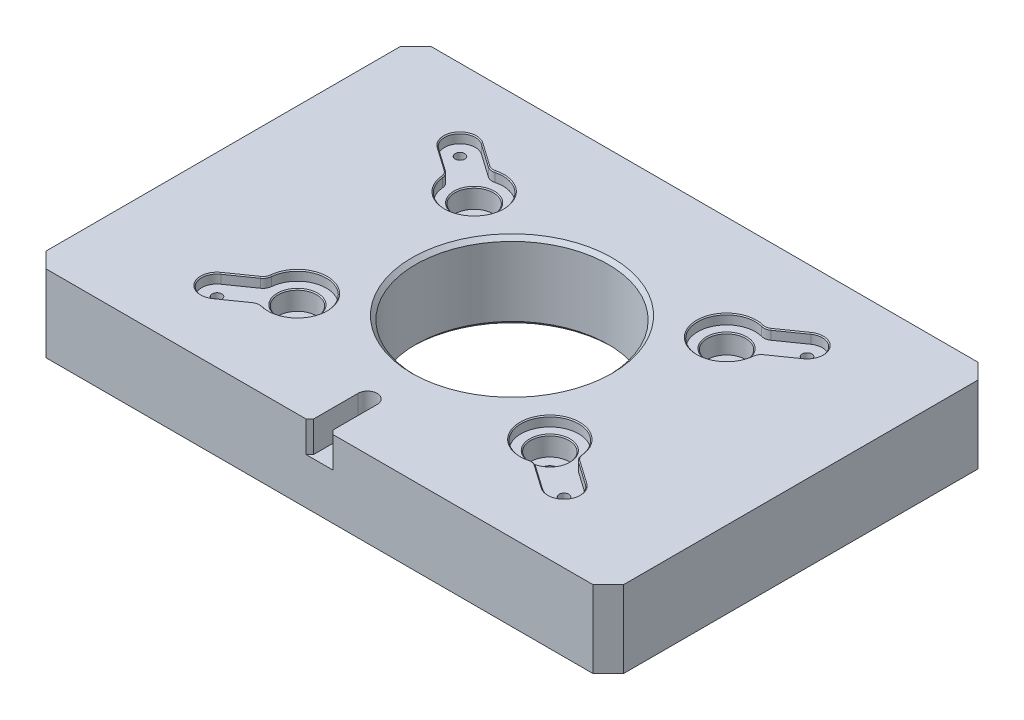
ISO-10303-21;
HEADER;
FILE_DESCRIPTION(('STEP AP214'),'2;1');
FILE_NAME('part.step','',(''),(''),'','','');
FILE_SCHEMA(('AUTOMOTIVE_DESIGN { 1 0 10303 214 1 1 1 1 }'));
ENDSEC;
DATA;
#1=APPLICATION_CONTEXT('core data for automotive mechanical design processes');
#2=APPLICATION_PROTOCOL_DEFINITION('international standard','automotive_design',2000,#1);
#3=PRODUCT_CONTEXT('',#1,'mechanical');
#4=PRODUCT('Part','Part','',(#3));
#5=PRODUCT_RELATED_PRODUCT_CATEGORY('part','',(#4));
#6=PRODUCT_DEFINITION_FORMATION('','',#4);
#7=PRODUCT_DEFINITION_CONTEXT('part definition',#1,'design');
#8=PRODUCT_DEFINITION('design','',#6,#7);
#9=PRODUCT_DEFINITION_SHAPE('','',#8);
#10=(LENGTH_UNIT() NAMED_UNIT(*) SI_UNIT(.MILLI.,.METRE.));
#11=(NAMED_UNIT(*) PLANE_ANGLE_UNIT() SI_UNIT($,.RADIAN.));
#12=(NAMED_UNIT(*) SI_UNIT($,.STERADIAN.) SOLID_ANGLE_UNIT());
#13=UNCERTAINTY_MEASURE_WITH_UNIT(LENGTH_MEASURE(1.E-05),#10,'distance_accuracy_value','');
#14=(GEOMETRIC_REPRESENTATION_CONTEXT(3) GLOBAL_UNCERTAINTY_ASSIGNED_CONTEXT((#13)) GLOBAL_UNIT_ASSIGNED_CONTEXT((#10,
#11,#12)) REPRESENTATION_CONTEXT('',''));
#15=CARTESIAN_POINT('',(0.,0.,0.));
#16=DIRECTION('',(0.,0.,1.));
#17=DIRECTION('',(1.,0.,0.));
#18=AXIS2_PLACEMENT_3D('',#15,#16,#17);
#19=CARTESIAN_POINT('',(-90.106724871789,35.,63.0934079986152));
#20=DIRECTION('',(0.,-1.,0.));
#21=DIRECTION('',(0.,0.,-1.));
#22=AXIS2_PLACEMENT_3D('',#19,#20,#21);
#23=PLANE('',#22);
#24=CARTESIAN_POINT('',(-65.5321635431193,35.,45.8861149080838));
#25=DIRECTION('',(0.,-1.,0.));
#26=DIRECTION('',(0.,0.,-1.));
#27=AXIS2_PLACEMENT_3D('',#24,#25,#26);
#28=CIRCLE('',#27,10.5);
#29=CARTESIAN_POINT('',(-65.5321635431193,35.,35.3861149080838));
#30=VERTEX_POINT('',#29);
#31=EDGE_CURVE('E814',#30,#30,#28,.T.);
#32=ORIENTED_EDGE('',*,*,#31,.T.);
#33=EDGE_LOOP('',(#32));
#34=FACE_BOUND('',#33,.T.);
#35=CARTESIAN_POINT('',(-90.106724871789,35.,63.0934079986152));
#36=DIRECTION('',(0.,-1.,0.));
#37=DIRECTION('',(0.,0.,-1.));
#38=AXIS2_PLACEMENT_3D('',#35,#36,#37);
#39=CIRCLE('',#38,7.99999999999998);
#40=CARTESIAN_POINT('',(-85.5181133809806,35.,69.6466243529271));
#41=VERTEX_POINT('',#40);
#42=CARTESIAN_POINT('',(-94.6953363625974,35.,56.5401916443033));
#43=VERTEX_POINT('',#42);
#44=EDGE_CURVE('E420',#41,#43,#39,.T.);
#45=ORIENTED_EDGE('',*,*,#44,.F.);
#46=DIRECTION('',(-0.819152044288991,0.,0.573576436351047));
#47=VECTOR('',#46,1.);
#48=CARTESIAN_POINT('',(-85.5181133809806,35.,69.6466243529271));
#49=LINE('',#48,#47);
#50=CARTESIAN_POINT('',(-73.393585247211,35.,61.1569383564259));
#51=VERTEX_POINT('',#50);
#52=EDGE_CURVE('E423',#51,#41,#49,.T.);
#53=ORIENTED_EDGE('',*,*,#52,.F.);
#54=CARTESIAN_POINT('',(-70.5257030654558,35.,65.2526985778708));
#55=DIRECTION('',(0.,-1.,0.));
#56=DIRECTION('',(0.,0.,-1.));
#57=AXIS2_PLACEMENT_3D('',#54,#55,#56);
#58=CIRCLE('',#57,5.);
#59=CARTESIAN_POINT('',(-69.2773181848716,35.,60.4110526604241));
#60=VERTEX_POINT('',#59);
#61=EDGE_CURVE('E784',#51,#60,#58,.T.);
#62=ORIENTED_EDGE('',*,*,#61,.T.);
#63=CARTESIAN_POINT('',(-65.5321635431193,35.,45.8861149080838));
#64=DIRECTION('',(0.,-1.,0.));
#65=DIRECTION('',(0.,0.,1.));
#66=AXIS2_PLACEMENT_3D('',#63,#64,#65);
#67=CIRCLE('',#66,15.);
#68=CARTESIAN_POINT('',(-80.4620586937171,35.,44.4375877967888));
#69=VERTEX_POINT('',#68);
#70=EDGE_CURVE('E425',#69,#60,#67,.T.);
#71=ORIENTED_EDGE('',*,*,#70,.F.);
#72=CARTESIAN_POINT('',(-85.438690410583,35.,43.9547454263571));
#73=DIRECTION('',(0.,-1.,0.));
#74=DIRECTION('',(0.,0.,-1.));
#75=AXIS2_PLACEMENT_3D('',#72,#73,#74);
#76=CIRCLE('',#75,5.);
#77=CARTESIAN_POINT('',(-82.5708082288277,35.,48.0505056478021));
#78=VERTEX_POINT('',#77);
#79=EDGE_CURVE('E786',#69,#78,#76,.T.);
#80=ORIENTED_EDGE('',*,*,#79,.T.);
#81=DIRECTION('',(0.819152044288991,0.,-0.573576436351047));
#82=VECTOR('',#81,1.);
#83=CARTESIAN_POINT('',(-94.6953363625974,35.,56.5401916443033));
#84=LINE('',#83,#82);
#85=EDGE_CURVE('E428',#43,#78,#84,.T.);
#86=ORIENTED_EDGE('',*,*,#85,.F.);
#87=EDGE_LOOP('',(#45,#53,#62,#71,#80,#86));
#88=FACE_BOUND('',#87,.T.);
#89=CARTESIAN_POINT('',(-90.106724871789,35.,63.0934079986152));
#90=DIRECTION('',(0.,1.,0.));
#91=DIRECTION('',(0.,0.,1.));
#92=AXIS2_PLACEMENT_3D('',#89,#90,#91);
#93=CIRCLE('',#92,2.49999999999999);
#94=CARTESIAN_POINT('',(-90.106724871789,35.,65.5934079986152));
#95=VERTEX_POINT('',#94);
#96=EDGE_CURVE('E413',#95,#95,#93,.T.);
#97=ORIENTED_EDGE('',*,*,#96,.F.);
#98=EDGE_LOOP('',(#97));
#99=FACE_BOUND('',#98,.T.);
#100=ADVANCED_FACE('F40',(#34,#88,#99),#23,.F.);
#101=CARTESIAN_POINT('',(0.,40.,0.));
#102=DIRECTION('',(0.,1.,0.));
#103=DIRECTION('',(0.,0.,1.));
#104=AXIS2_PLACEMENT_3D('',#101,#102,#103);
#105=PLANE('',#104);
#106=DIRECTION('',(0.,0.,-1.));
#107=VECTOR('',#106,1.);
#108=CARTESIAN_POINT('',(5.,40.,100.));
#109=LINE('',#108,#107);
#110=CARTESIAN_POINT('',(5.00000000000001,40.,98.));
#111=VERTEX_POINT('',#110);
#112=CARTESIAN_POINT('',(5.,40.,75.));
#113=VERTEX_POINT('',#112);
#114=EDGE_CURVE('E383',#111,#113,#109,.T.);
#115=ORIENTED_EDGE('',*,*,#114,.F.);
#116=DIRECTION('',(-0.707106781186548,0.,-0.707106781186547));
#117=VECTOR('',#116,1.);
#118=CARTESIAN_POINT('',(-46.5,40.,46.5000000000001));
#119=LINE('',#118,#117);
#120=CARTESIAN_POINT('',(7.00000000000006,40.,100.));
#121=VERTEX_POINT('',#120);
#122=EDGE_CURVE('E878',#111,#121,#119,.F.);
#123=ORIENTED_EDGE('',*,*,#122,.T.);
#124=DIRECTION('',(1.,0.,0.));
#125=VECTOR('',#124,1.);
#126=CARTESIAN_POINT('',(-150.,40.,100.));
#127=LINE('',#126,#125);
#128=CARTESIAN_POINT('',(142.,40.,100.));
#129=VERTEX_POINT('',#128);
#130=EDGE_CURVE('E552',#121,#129,#127,.T.);
#131=ORIENTED_EDGE('',*,*,#130,.T.);
#132=DIRECTION('',(-0.70710678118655,0.,0.707106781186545));
#133=VECTOR('',#132,1.);
#134=CARTESIAN_POINT('',(121.,40.,121.));
#135=LINE('',#134,#133);
#136=CARTESIAN_POINT('',(150.,40.,91.9999999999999));
#137=VERTEX_POINT('',#136);
#138=EDGE_CURVE('E857',#129,#137,#135,.F.);
#139=ORIENTED_EDGE('',*,*,#138,.T.);
#140=DIRECTION('',(0.,0.,-1.));
#141=VECTOR('',#140,1.);
#142=CARTESIAN_POINT('',(150.,40.,-100.));
#143=LINE('',#142,#141);
#144=CARTESIAN_POINT('',(150.,40.,-91.9999999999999));
#145=VERTEX_POINT('',#144);
#146=EDGE_CURVE('E557',#137,#145,#143,.T.);
#147=ORIENTED_EDGE('',*,*,#146,.T.);
#148=DIRECTION('',(0.707106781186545,0.,0.70710678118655));
#149=VECTOR('',#148,1.);
#150=CARTESIAN_POINT('',(121.,40.,-121.));
#151=LINE('',#150,#149);
#152=CARTESIAN_POINT('',(142.,40.,-100.));
#153=VERTEX_POINT('',#152);
#154=EDGE_CURVE('E859',#145,#153,#151,.F.);
#155=ORIENTED_EDGE('',*,*,#154,.T.);
#156=DIRECTION('',(-1.,0.,0.));
#157=VECTOR('',#156,1.);
#158=CARTESIAN_POINT('',(-150.,40.,-100.));
#159=LINE('',#158,#157);
#160=CARTESIAN_POINT('',(-142.,40.,-100.));
#161=VERTEX_POINT('',#160);
#162=EDGE_CURVE('E560',#153,#161,#159,.T.);
#163=ORIENTED_EDGE('',*,*,#162,.T.);
#164=DIRECTION('',(0.70710678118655,0.,-0.707106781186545));
#165=VECTOR('',#164,1.);
#166=CARTESIAN_POINT('',(-121.,40.,-121.));
#167=LINE('',#166,#165);
#168=CARTESIAN_POINT('',(-150.,40.,-92.));
#169=VERTEX_POINT('',#168);
#170=EDGE_CURVE('E861',#161,#169,#167,.F.);
#171=ORIENTED_EDGE('',*,*,#170,.T.);
#172=DIRECTION('',(0.,0.,1.));
#173=VECTOR('',#172,1.);
#174=CARTESIAN_POINT('',(-150.,40.,-100.));
#175=LINE('',#174,#173);
#176=CARTESIAN_POINT('',(-150.,40.,91.9999999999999));
#177=VERTEX_POINT('',#176);
#178=EDGE_CURVE('E549',#169,#177,#175,.T.);
#179=ORIENTED_EDGE('',*,*,#178,.T.);
#180=DIRECTION('',(-0.707106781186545,0.,-0.70710678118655));
#181=VECTOR('',#180,1.);
#182=CARTESIAN_POINT('',(-121.,40.,121.));
#183=LINE('',#182,#181);
#184=CARTESIAN_POINT('',(-142.,40.,100.));
#185=VERTEX_POINT('',#184);
#186=EDGE_CURVE('E855',#177,#185,#183,.F.);
#187=ORIENTED_EDGE('',*,*,#186,.T.);
#188=CARTESIAN_POINT('',(-7.00000000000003,40.,100.));
#189=VERTEX_POINT('',#188);
#190=EDGE_CURVE('E554',#185,#189,#127,.T.);
#191=ORIENTED_EDGE('',*,*,#190,.T.);
#192=DIRECTION('',(-0.707106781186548,0.,0.707106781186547));
#193=VECTOR('',#192,1.);
#194=CARTESIAN_POINT('',(46.5,40.,46.5000000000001));
#195=LINE('',#194,#193);
#196=CARTESIAN_POINT('',(-5.,40.,98.));
#197=VERTEX_POINT('',#196);
#198=EDGE_CURVE('E876',#189,#197,#195,.F.);
#199=ORIENTED_EDGE('',*,*,#198,.T.);
#200=DIRECTION('',(0.,0.,1.));
#201=VECTOR('',#200,1.);
#202=CARTESIAN_POINT('',(-5.,40.,100.));
#203=LINE('',#202,#201);
#204=CARTESIAN_POINT('',(-5.,40.,75.));
#205=VERTEX_POINT('',#204);
#206=EDGE_CURVE('E393',#205,#197,#203,.T.);
#207=ORIENTED_EDGE('',*,*,#206,.F.);
#208=CARTESIAN_POINT('',(0.,40.,75.));
#209=DIRECTION('',(0.,1.,0.));
#210=DIRECTION('',(0.,0.,-1.));
#211=AXIS2_PLACEMENT_3D('',#208,#209,#210);
#212=CIRCLE('',#211,5.);
#213=EDGE_CURVE('E396',#113,#205,#212,.T.);
#214=ORIENTED_EDGE('',*,*,#213,.F.);
#215=EDGE_LOOP('',(#115,#123,#131,#139,#147,#155,#163,#171,#179,#187,#191,#199,#207,#214));
#216=FACE_BOUND('',#215,.T.);
#217=DIRECTION('',(-0.819152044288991,0.,0.573576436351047));
#218=VECTOR('',#217,1.);
#219=CARTESIAN_POINT('',(4.87539970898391,40.,6.96279237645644));
#220=LINE('',#219,#218);
#221=CARTESIAN_POINT('',(-73.1067970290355,40.,61.5665143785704));
#222=VERTEX_POINT('',#221);
#223=CARTESIAN_POINT('',(-85.2313251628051,40.,70.0562003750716));
#224=VERTEX_POINT('',#223);
#225=EDGE_CURVE('E794',#222,#224,#220,.T.);
#226=ORIENTED_EDGE('',*,*,#225,.T.);
#227=CARTESIAN_POINT('',(-90.106724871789,40.,63.0934079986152));
#228=DIRECTION('',(0.,1.,0.));
#229=DIRECTION('',(0.,0.,1.));
#230=AXIS2_PLACEMENT_3D('',#227,#228,#229);
#231=CIRCLE('',#230,8.49999999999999);
#232=CARTESIAN_POINT('',(-94.9821245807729,40.,56.1306156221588));
#233=VERTEX_POINT('',#232);
#234=EDGE_CURVE('E798',#224,#233,#231,.F.);
#235=ORIENTED_EDGE('',*,*,#234,.T.);
#236=DIRECTION('',(0.819152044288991,0.,-0.573576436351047));
#237=VECTOR('',#236,1.);
#238=CARTESIAN_POINT('',(-4.87539970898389,40.,-6.96279237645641));
#239=LINE('',#238,#237);
#240=CARTESIAN_POINT('',(-82.8575964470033,40.,47.6409296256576));
#241=VERTEX_POINT('',#240);
#242=EDGE_CURVE('E796',#233,#241,#239,.T.);
#243=ORIENTED_EDGE('',*,*,#242,.T.);
#244=CARTESIAN_POINT('',(-85.438690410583,40.,43.9547454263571));
#245=DIRECTION('',(0.,1.,0.));
#246=DIRECTION('',(0.,0.,1.));
#247=AXIS2_PLACEMENT_3D('',#244,#245,#246);
#248=CIRCLE('',#247,4.49999999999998);
#249=CARTESIAN_POINT('',(-80.9597218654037,40.,44.3893035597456));
#250=VERTEX_POINT('',#249);
#251=EDGE_CURVE('E792',#241,#250,#248,.T.);
#252=ORIENTED_EDGE('',*,*,#251,.T.);
#253=CARTESIAN_POINT('',(-65.5321635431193,40.,45.8861149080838));
#254=DIRECTION('',(0.,1.,0.));
#255=DIRECTION('',(0.,0.,1.));
#256=AXIS2_PLACEMENT_3D('',#253,#254,#255);
#257=CIRCLE('',#256,15.5);
#258=CARTESIAN_POINT('',(-69.4021566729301,40.,60.8952172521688));
#259=VERTEX_POINT('',#258);
#260=EDGE_CURVE('E788',#250,#259,#257,.F.);
#261=ORIENTED_EDGE('',*,*,#260,.T.);
#262=CARTESIAN_POINT('',(-70.5257030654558,40.,65.2526985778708));
#263=DIRECTION('',(0.,1.,0.));
#264=DIRECTION('',(0.,0.,1.));
#265=AXIS2_PLACEMENT_3D('',#262,#263,#264);
#266=CIRCLE('',#265,4.49999999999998);
#267=EDGE_CURVE('E790',#259,#222,#266,.T.);
#268=ORIENTED_EDGE('',*,*,#267,.T.);
#269=EDGE_LOOP('',(#226,#235,#243,#252,#261,#268));
#270=FACE_BOUND('',#269,.T.);
#271=CARTESIAN_POINT('',(0.,40.,0.));
#272=DIRECTION('',(0.,1.,0.));
#273=DIRECTION('',(0.,0.,1.));
#274=AXIS2_PLACEMENT_3D('',#271,#272,#273);
#275=CIRCLE('',#274,52.);
#276=CARTESIAN_POINT('',(0.,40.,52.));
#277=VERTEX_POINT('',#276);
#278=EDGE_CURVE('E643',#277,#277,#275,.F.);
#279=ORIENTED_EDGE('',*,*,#278,.T.);
#280=EDGE_LOOP('',(#279));
#281=FACE_BOUND('',#280,.T.);
#282=DIRECTION('',(0.819152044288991,0.,0.573576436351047));
#283=VECTOR('',#282,1.);
#284=CARTESIAN_POINT('',(94.9821245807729,40.,56.1306156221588));
#285=LINE('',#284,#283);
#286=CARTESIAN_POINT('',(82.8575964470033,40.,47.6409296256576));
#287=VERTEX_POINT('',#286);
#288=CARTESIAN_POINT('',(94.9821245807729,40.,56.1306156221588));
#289=VERTEX_POINT('',#288);
#290=EDGE_CURVE('E598',#287,#289,#285,.T.);
#291=ORIENTED_EDGE('',*,*,#290,.T.);
#292=CARTESIAN_POINT('',(90.106724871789,40.,63.0934079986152));
#293=DIRECTION('',(0.,1.,0.));
#294=DIRECTION('',(0.,0.,1.));
#295=AXIS2_PLACEMENT_3D('',#292,#293,#294);
#296=CIRCLE('',#295,8.49999999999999);
#297=CARTESIAN_POINT('',(85.2313251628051,40.,70.0562003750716));
#298=VERTEX_POINT('',#297);
#299=EDGE_CURVE('E600',#289,#298,#296,.F.);
#300=ORIENTED_EDGE('',*,*,#299,.T.);
#301=DIRECTION('',(-0.819152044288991,0.,-0.573576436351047));
#302=VECTOR('',#301,1.);
#303=CARTESIAN_POINT('',(73.1067970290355,40.,61.5665143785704));
#304=LINE('',#303,#302);
#305=CARTESIAN_POINT('',(73.1067970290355,40.,61.5665143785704));
#306=VERTEX_POINT('',#305);
#307=EDGE_CURVE('E596',#298,#306,#304,.T.);
#308=ORIENTED_EDGE('',*,*,#307,.T.);
#309=CARTESIAN_POINT('',(70.5257030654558,40.,65.2526985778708));
#310=DIRECTION('',(0.,1.,0.));
#311=DIRECTION('',(0.,0.,1.));
#312=AXIS2_PLACEMENT_3D('',#309,#310,#311);
#313=CIRCLE('',#312,4.49999999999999);
#314=CARTESIAN_POINT('',(69.4021566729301,40.,60.8952172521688));
#315=VERTEX_POINT('',#314);
#316=EDGE_CURVE('E592',#306,#315,#313,.T.);
#317=ORIENTED_EDGE('',*,*,#316,.T.);
#318=CARTESIAN_POINT('',(65.5321635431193,40.,45.8861149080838));
#319=DIRECTION('',(0.,1.,0.));
#320=DIRECTION('',(0.,0.,1.));
#321=AXIS2_PLACEMENT_3D('',#318,#319,#320);
#322=CIRCLE('',#321,15.5);
#323=CARTESIAN_POINT('',(80.9597218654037,40.,44.3893035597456));
#324=VERTEX_POINT('',#323);
#325=EDGE_CURVE('E590',#315,#324,#322,.F.);
#326=ORIENTED_EDGE('',*,*,#325,.T.);
#327=CARTESIAN_POINT('',(85.438690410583,40.,43.9547454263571));
#328=DIRECTION('',(0.,1.,0.));
#329=DIRECTION('',(0.,0.,1.));
#330=AXIS2_PLACEMENT_3D('',#327,#328,#329);
#331=CIRCLE('',#330,4.49999999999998);
#332=EDGE_CURVE('E594',#324,#287,#331,.T.);
#333=ORIENTED_EDGE('',*,*,#332,.T.);
#334=EDGE_LOOP('',(#291,#300,#308,#317,#326,#333));
#335=FACE_BOUND('',#334,.T.);
#336=DIRECTION('',(0.819152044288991,0.,-0.573576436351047));
#337=VECTOR('',#336,1.);
#338=CARTESIAN_POINT('',(-4.87539970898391,40.,-6.96279237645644));
#339=LINE('',#338,#337);
#340=CARTESIAN_POINT('',(73.1067970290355,40.,-61.5665143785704));
#341=VERTEX_POINT('',#340);
#342=CARTESIAN_POINT('',(85.2313251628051,40.,-70.0562003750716));
#343=VERTEX_POINT('',#342);
#344=EDGE_CURVE('E668',#341,#343,#339,.T.);
#345=ORIENTED_EDGE('',*,*,#344,.T.);
#346=CARTESIAN_POINT('',(90.106724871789,40.,-63.0934079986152));
#347=DIRECTION('',(0.,1.,0.));
#348=DIRECTION('',(0.,0.,1.));
#349=AXIS2_PLACEMENT_3D('',#346,#347,#348);
#350=CIRCLE('',#349,8.49999999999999);
#351=CARTESIAN_POINT('',(94.9821245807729,40.,-56.1306156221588));
#352=VERTEX_POINT('',#351);
#353=EDGE_CURVE('E672',#343,#352,#350,.F.);
#354=ORIENTED_EDGE('',*,*,#353,.T.);
#355=DIRECTION('',(-0.819152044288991,0.,0.573576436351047));
#356=VECTOR('',#355,1.);
#357=CARTESIAN_POINT('',(4.87539970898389,40.,6.96279237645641));
#358=LINE('',#357,#356);
#359=CARTESIAN_POINT('',(82.8575964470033,40.,-47.6409296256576));
#360=VERTEX_POINT('',#359);
#361=EDGE_CURVE('E670',#352,#360,#358,.T.);
#362=ORIENTED_EDGE('',*,*,#361,.T.);
#363=CARTESIAN_POINT('',(85.438690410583,40.,-43.9547454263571));
#364=DIRECTION('',(0.,1.,0.));
#365=DIRECTION('',(0.,0.,1.));
#366=AXIS2_PLACEMENT_3D('',#363,#364,#365);
#367=CIRCLE('',#366,4.49999999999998);
#368=CARTESIAN_POINT('',(80.9597218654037,40.,-44.3893035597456));
#369=VERTEX_POINT('',#368);
#370=EDGE_CURVE('E666',#360,#369,#367,.T.);
#371=ORIENTED_EDGE('',*,*,#370,.T.);
#372=CARTESIAN_POINT('',(65.5321635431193,40.,-45.8861149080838));
#373=DIRECTION('',(0.,1.,0.));
#374=DIRECTION('',(0.,0.,1.));
#375=AXIS2_PLACEMENT_3D('',#372,#373,#374);
#376=CIRCLE('',#375,15.5);
#377=CARTESIAN_POINT('',(69.4021566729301,40.,-60.8952172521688));
#378=VERTEX_POINT('',#377);
#379=EDGE_CURVE('E662',#369,#378,#376,.F.);
#380=ORIENTED_EDGE('',*,*,#379,.T.);
#381=CARTESIAN_POINT('',(70.5257030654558,40.,-65.2526985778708));
#382=DIRECTION('',(0.,1.,0.));
#383=DIRECTION('',(0.,0.,1.));
#384=AXIS2_PLACEMENT_3D('',#381,#382,#383);
#385=CIRCLE('',#384,4.49999999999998);
#386=EDGE_CURVE('E664',#378,#341,#385,.T.);
#387=ORIENTED_EDGE('',*,*,#386,.T.);
#388=EDGE_LOOP('',(#345,#354,#362,#371,#380,#387));
#389=FACE_BOUND('',#388,.T.);
#390=DIRECTION('',(-0.819152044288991,0.,-0.573576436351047));
#391=VECTOR('',#390,1.);
#392=CARTESIAN_POINT('',(-94.9821245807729,40.,-56.1306156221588));
#393=LINE('',#392,#391);
#394=CARTESIAN_POINT('',(-82.8575964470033,40.,-47.6409296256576));
#395=VERTEX_POINT('',#394);
#396=CARTESIAN_POINT('',(-94.9821245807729,40.,-56.1306156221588));
#397=VERTEX_POINT('',#396);
#398=EDGE_CURVE('E736',#395,#397,#393,.T.);
#399=ORIENTED_EDGE('',*,*,#398,.T.);
#400=CARTESIAN_POINT('',(-90.106724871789,40.,-63.0934079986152));
#401=DIRECTION('',(0.,1.,0.));
#402=DIRECTION('',(0.,0.,1.));
#403=AXIS2_PLACEMENT_3D('',#400,#401,#402);
#404=CIRCLE('',#403,8.49999999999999);
#405=CARTESIAN_POINT('',(-85.2313251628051,40.,-70.0562003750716));
#406=VERTEX_POINT('',#405);
#407=EDGE_CURVE('E738',#397,#406,#404,.F.);
#408=ORIENTED_EDGE('',*,*,#407,.T.);
#409=DIRECTION('',(0.819152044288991,0.,0.573576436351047));
#410=VECTOR('',#409,1.);
#411=CARTESIAN_POINT('',(-73.1067970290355,40.,-61.5665143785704));
#412=LINE('',#411,#410);
#413=CARTESIAN_POINT('',(-73.1067970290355,40.,-61.5665143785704));
#414=VERTEX_POINT('',#413);
#415=EDGE_CURVE('E734',#406,#414,#412,.T.);
#416=ORIENTED_EDGE('',*,*,#415,.T.);
#417=CARTESIAN_POINT('',(-70.5257030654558,40.,-65.2526985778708));
#418=DIRECTION('',(0.,1.,0.));
#419=DIRECTION('',(0.,0.,1.));
#420=AXIS2_PLACEMENT_3D('',#417,#418,#419);
#421=CIRCLE('',#420,4.49999999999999);
#422=CARTESIAN_POINT('',(-69.4021566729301,40.,-60.8952172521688));
#423=VERTEX_POINT('',#422);
#424=EDGE_CURVE('E730',#414,#423,#421,.T.);
#425=ORIENTED_EDGE('',*,*,#424,.T.);
#426=CARTESIAN_POINT('',(-65.5321635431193,40.,-45.8861149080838));
#427=DIRECTION('',(0.,1.,0.));
#428=DIRECTION('',(0.,0.,1.));
#429=AXIS2_PLACEMENT_3D('',#426,#427,#428);
#430=CIRCLE('',#429,15.5);
#431=CARTESIAN_POINT('',(-80.9597218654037,40.,-44.3893035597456));
#432=VERTEX_POINT('',#431);
#433=EDGE_CURVE('E728',#423,#432,#430,.F.);
#434=ORIENTED_EDGE('',*,*,#433,.T.);
#435=CARTESIAN_POINT('',(-85.438690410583,40.,-43.9547454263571));
#436=DIRECTION('',(0.,1.,0.));
#437=DIRECTION('',(0.,0.,1.));
#438=AXIS2_PLACEMENT_3D('',#435,#436,#437);
#439=CIRCLE('',#438,4.49999999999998);
#440=EDGE_CURVE('E732',#432,#395,#439,.T.);
#441=ORIENTED_EDGE('',*,*,#440,.T.);
#442=EDGE_LOOP('',(#399,#408,#416,#425,#434,#441));
#443=FACE_BOUND('',#442,.T.);
#444=ADVANCED_FACE('F892',(#216,#270,#281,#335,#389,#443),#105,.T.);
#445=CARTESIAN_POINT('',(90.106724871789,35.,-63.0934079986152));
#446=DIRECTION('',(0.,-1.,0.));
#447=DIRECTION('',(0.,0.,1.));
#448=AXIS2_PLACEMENT_3D('',#445,#446,#447);
#449=PLANE('',#448);
#450=CARTESIAN_POINT('',(65.5321635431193,35.,-45.8861149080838));
#451=DIRECTION('',(0.,-1.,0.));
#452=DIRECTION('',(0.,0.,-1.));
#453=AXIS2_PLACEMENT_3D('',#450,#451,#452);
#454=CIRCLE('',#453,10.5);
#455=CARTESIAN_POINT('',(65.5321635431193,35.,-56.3861149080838));
#456=VERTEX_POINT('',#455);
#457=EDGE_CURVE('E688',#456,#456,#454,.T.);
#458=ORIENTED_EDGE('',*,*,#457,.T.);
#459=EDGE_LOOP('',(#458));
#460=FACE_BOUND('',#459,.T.);
#461=CARTESIAN_POINT('',(90.106724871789,35.,-63.0934079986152));
#462=DIRECTION('',(0.,-1.,0.));
#463=DIRECTION('',(0.,0.,1.));
#464=AXIS2_PLACEMENT_3D('',#461,#462,#463);
#465=CIRCLE('',#464,7.99999999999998);
#466=CARTESIAN_POINT('',(85.5181133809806,35.,-69.6466243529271));
#467=VERTEX_POINT('',#466);
#468=CARTESIAN_POINT('',(94.6953363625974,35.,-56.5401916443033));
#469=VERTEX_POINT('',#468);
#470=EDGE_CURVE('E494',#467,#469,#465,.T.);
#471=ORIENTED_EDGE('',*,*,#470,.F.);
#472=DIRECTION('',(0.819152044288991,0.,-0.573576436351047));
#473=VECTOR('',#472,1.);
#474=CARTESIAN_POINT('',(85.5181133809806,35.,-69.6466243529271));
#475=LINE('',#474,#473);
#476=CARTESIAN_POINT('',(73.393585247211,35.,-61.1569383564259));
#477=VERTEX_POINT('',#476);
#478=EDGE_CURVE('E497',#477,#467,#475,.T.);
#479=ORIENTED_EDGE('',*,*,#478,.F.);
#480=CARTESIAN_POINT('',(70.5257030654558,35.,-65.2526985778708));
#481=DIRECTION('',(0.,-1.,0.));
#482=DIRECTION('',(0.,0.,-1.));
#483=AXIS2_PLACEMENT_3D('',#480,#481,#482);
#484=CIRCLE('',#483,5.);
#485=CARTESIAN_POINT('',(69.2773181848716,35.,-60.4110526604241));
#486=VERTEX_POINT('',#485);
#487=EDGE_CURVE('E658',#477,#486,#484,.T.);
#488=ORIENTED_EDGE('',*,*,#487,.T.);
#489=CARTESIAN_POINT('',(65.5321635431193,35.,-45.8861149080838));
#490=DIRECTION('',(0.,-1.,0.));
#491=DIRECTION('',(0.,0.,-1.));
#492=AXIS2_PLACEMENT_3D('',#489,#490,#491);
#493=CIRCLE('',#492,15.);
#494=CARTESIAN_POINT('',(80.4620586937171,35.,-44.4375877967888));
#495=VERTEX_POINT('',#494);
#496=EDGE_CURVE('E499',#495,#486,#493,.T.);
#497=ORIENTED_EDGE('',*,*,#496,.F.);
#498=CARTESIAN_POINT('',(85.438690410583,35.,-43.9547454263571));
#499=DIRECTION('',(0.,-1.,0.));
#500=DIRECTION('',(0.,0.,-1.));
#501=AXIS2_PLACEMENT_3D('',#498,#499,#500);
#502=CIRCLE('',#501,5.);
#503=CARTESIAN_POINT('',(82.5708082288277,35.,-48.0505056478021));
#504=VERTEX_POINT('',#503);
#505=EDGE_CURVE('E660',#495,#504,#502,.T.);
#506=ORIENTED_EDGE('',*,*,#505,.T.);
#507=DIRECTION('',(-0.819152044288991,0.,0.573576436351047));
#508=VECTOR('',#507,1.);
#509=CARTESIAN_POINT('',(94.6953363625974,35.,-56.5401916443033));
#510=LINE('',#509,#508);
#511=EDGE_CURVE('E502',#469,#504,#510,.T.);
#512=ORIENTED_EDGE('',*,*,#511,.F.);
#513=EDGE_LOOP('',(#471,#479,#488,#497,#506,#512));
#514=FACE_BOUND('',#513,.T.);
#515=CARTESIAN_POINT('',(90.106724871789,35.,-63.0934079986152));
#516=DIRECTION('',(0.,1.,0.));
#517=DIRECTION('',(0.,0.,1.));
#518=AXIS2_PLACEMENT_3D('',#515,#516,#517);
#519=CIRCLE('',#518,2.49999999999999);
#520=CARTESIAN_POINT('',(90.106724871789,35.,-60.5934079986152));
#521=VERTEX_POINT('',#520);
#522=EDGE_CURVE('E487',#521,#521,#519,.T.);
#523=ORIENTED_EDGE('',*,*,#522,.F.);
#524=EDGE_LOOP('',(#523));
#525=FACE_BOUND('',#524,.T.);
#526=ADVANCED_FACE('F943',(#460,#514,#525),#449,.F.);
#527=CARTESIAN_POINT('',(0.,0.,0.));
#528=DIRECTION('',(0.,1.,0.));
#529=DIRECTION('',(0.,0.,1.));
#530=AXIS2_PLACEMENT_3D('',#527,#528,#529);
#531=PLANE('',#530);
#532=CARTESIAN_POINT('',(-65.5321635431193,0.,45.8861149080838));
#533=DIRECTION('',(0.,-1.,0.));
#534=DIRECTION('',(0.,0.,-1.));
#535=AXIS2_PLACEMENT_3D('',#532,#533,#534);
#536=CIRCLE('',#535,7.5);
#537=CARTESIAN_POINT('',(-65.5321635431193,0.,38.3861149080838));
#538=VERTEX_POINT('',#537);
#539=EDGE_CURVE('E399',#538,#538,#536,.T.);
#540=ORIENTED_EDGE('',*,*,#539,.F.);
#541=EDGE_LOOP('',(#540));
#542=FACE_BOUND('',#541,.T.);
#543=CARTESIAN_POINT('',(-65.5321635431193,0.,-45.8861149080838));
#544=DIRECTION('',(0.,-1.,0.));
#545=DIRECTION('',(0.,0.,-1.));
#546=AXIS2_PLACEMENT_3D('',#543,#544,#545);
#547=CIRCLE('',#546,7.5);
#548=CARTESIAN_POINT('',(-65.5321635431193,0.,-53.3861149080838));
#549=VERTEX_POINT('',#548);
#550=EDGE_CURVE('E435',#549,#549,#547,.T.);
#551=ORIENTED_EDGE('',*,*,#550,.F.);
#552=EDGE_LOOP('',(#551));
#553=FACE_BOUND('',#552,.T.);
#554=CARTESIAN_POINT('',(65.5321635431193,0.,-45.8861149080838));
#555=DIRECTION('',(0.,-1.,0.));
#556=DIRECTION('',(0.,0.,-1.));
#557=AXIS2_PLACEMENT_3D('',#554,#555,#556);
#558=CIRCLE('',#557,7.49999999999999);
#559=CARTESIAN_POINT('',(65.5321635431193,0.,-53.3861149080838));
#560=VERTEX_POINT('',#559);
#561=EDGE_CURVE('E472',#560,#560,#558,.T.);
#562=ORIENTED_EDGE('',*,*,#561,.F.);
#563=EDGE_LOOP('',(#562));
#564=FACE_BOUND('',#563,.T.);
#565=CARTESIAN_POINT('',(65.5321635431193,0.,45.8861149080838));
#566=DIRECTION('',(0.,-1.,0.));
#567=DIRECTION('',(0.,0.,-1.));
#568=AXIS2_PLACEMENT_3D('',#565,#566,#567);
#569=CIRCLE('',#568,7.49999999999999);
#570=CARTESIAN_POINT('',(65.5321635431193,0.,38.3861149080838));
#571=VERTEX_POINT('',#570);
#572=EDGE_CURVE('E509',#571,#571,#569,.T.);
#573=ORIENTED_EDGE('',*,*,#572,.F.);
#574=EDGE_LOOP('',(#573));
#575=FACE_BOUND('',#574,.T.);
#576=CARTESIAN_POINT('',(0.,0.,0.));
#577=DIRECTION('',(0.,1.,0.));
#578=DIRECTION('',(0.,0.,1.));
#579=AXIS2_PLACEMENT_3D('',#576,#577,#578);
#580=CIRCLE('',#579,52.);
#581=CARTESIAN_POINT('',(0.,0.,52.));
#582=VERTEX_POINT('',#581);
#583=EDGE_CURVE('E619',#582,#582,#580,.T.);
#584=ORIENTED_EDGE('',*,*,#583,.T.);
#585=EDGE_LOOP('',(#584));
#586=FACE_BOUND('',#585,.T.);
#587=DIRECTION('',(0.,0.,1.));
#588=VECTOR('',#587,1.);
#589=CARTESIAN_POINT('',(-150.,0.,-100.));
#590=LINE('',#589,#588);
#591=CARTESIAN_POINT('',(-150.,0.,-92.));
#592=VERTEX_POINT('',#591);
#593=CARTESIAN_POINT('',(-150.,0.,92.));
#594=VERTEX_POINT('',#593);
#595=EDGE_CURVE('E546',#592,#594,#590,.T.);
#596=ORIENTED_EDGE('',*,*,#595,.F.);
#597=DIRECTION('',(-0.70710678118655,0.,0.707106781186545));
#598=VECTOR('',#597,1.);
#599=CARTESIAN_POINT('',(-150.,0.,-92.));
#600=LINE('',#599,#598);
#601=CARTESIAN_POINT('',(-142.,0.,-100.));
#602=VERTEX_POINT('',#601);
#603=EDGE_CURVE('E848',#592,#602,#600,.F.);
#604=ORIENTED_EDGE('',*,*,#603,.T.);
#605=DIRECTION('',(-1.,0.,0.));
#606=VECTOR('',#605,1.);
#607=CARTESIAN_POINT('',(-150.,0.,-100.));
#608=LINE('',#607,#606);
#609=CARTESIAN_POINT('',(142.,0.,-100.));
#610=VERTEX_POINT('',#609);
#611=EDGE_CURVE('E553',#610,#602,#608,.T.);
#612=ORIENTED_EDGE('',*,*,#611,.F.);
#613=DIRECTION('',(-0.707106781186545,0.,-0.70710678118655));
#614=VECTOR('',#613,1.);
#615=CARTESIAN_POINT('',(142.,0.,-100.));
#616=LINE('',#615,#614);
#617=CARTESIAN_POINT('',(150.,0.,-92.));
#618=VERTEX_POINT('',#617);
#619=EDGE_CURVE('E846',#610,#618,#616,.F.);
#620=ORIENTED_EDGE('',*,*,#619,.T.);
#621=DIRECTION('',(0.,0.,-1.));
#622=VECTOR('',#621,1.);
#623=CARTESIAN_POINT('',(150.,0.,-100.));
#624=LINE('',#623,#622);
#625=CARTESIAN_POINT('',(150.,0.,92.));
#626=VERTEX_POINT('',#625);
#627=EDGE_CURVE('E569',#626,#618,#624,.T.);
#628=ORIENTED_EDGE('',*,*,#627,.F.);
#629=DIRECTION('',(0.70710678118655,0.,-0.707106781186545));
#630=VECTOR('',#629,1.);
#631=CARTESIAN_POINT('',(150.,0.,92.));
#632=LINE('',#631,#630);
#633=CARTESIAN_POINT('',(142.,0.,100.));
#634=VERTEX_POINT('',#633);
#635=EDGE_CURVE('E844',#626,#634,#632,.F.);
#636=ORIENTED_EDGE('',*,*,#635,.T.);
#637=DIRECTION('',(1.,0.,0.));
#638=VECTOR('',#637,1.);
#639=CARTESIAN_POINT('',(-150.,0.,100.));
#640=LINE('',#639,#638);
#641=CARTESIAN_POINT('',(-142.,0.,100.));
#642=VERTEX_POINT('',#641);
#643=EDGE_CURVE('E566',#642,#634,#640,.T.);
#644=ORIENTED_EDGE('',*,*,#643,.F.);
#645=DIRECTION('',(0.707106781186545,0.,0.70710678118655));
#646=VECTOR('',#645,1.);
#647=CARTESIAN_POINT('',(-142.,0.,100.));
#648=LINE('',#647,#646);
#649=EDGE_CURVE('E842',#642,#594,#648,.F.);
#650=ORIENTED_EDGE('',*,*,#649,.T.);
#651=EDGE_LOOP('',(#596,#604,#612,#620,#628,#636,#644,#650));
#652=FACE_BOUND('',#651,.T.);
#653=ADVANCED_FACE('F911',(#542,#553,#564,#575,#586,#652),#531,.F.);
#654=CARTESIAN_POINT('',(-150.,40.,-100.));
#655=DIRECTION('',(1.,0.,0.));
#656=DIRECTION('',(0.,0.,-1.));
#657=AXIS2_PLACEMENT_3D('',#654,#655,#656);
#658=PLANE('',#657);
#659=ORIENTED_EDGE('',*,*,#178,.F.);
#660=DIRECTION('',(0.,-1.,0.));
#661=VECTOR('',#660,1.);
#662=CARTESIAN_POINT('',(-150.,40.,-92.));
#663=LINE('',#662,#661);
#664=EDGE_CURVE('E839',#169,#592,#663,.T.);
#665=ORIENTED_EDGE('',*,*,#664,.T.);
#666=ORIENTED_EDGE('',*,*,#595,.T.);
#667=DIRECTION('',(0.,1.,0.));
#668=VECTOR('',#667,1.);
#669=CARTESIAN_POINT('',(-150.,40.,92.));
#670=LINE('',#669,#668);
#671=EDGE_CURVE('E820',#594,#177,#670,.T.);
#672=ORIENTED_EDGE('',*,*,#671,.T.);
#673=EDGE_LOOP('',(#659,#665,#666,#672));
#674=FACE_BOUND('',#673,.T.);
#675=ADVANCED_FACE('F935',(#674),#658,.F.);
#676=CARTESIAN_POINT('',(-150.,40.,100.));
#677=DIRECTION('',(0.,0.,-1.));
#678=DIRECTION('',(-1.,0.,0.));
#679=AXIS2_PLACEMENT_3D('',#676,#677,#678);
#680=PLANE('',#679);
#681=ORIENTED_EDGE('',*,*,#130,.F.);
#682=DIRECTION('',(0.,-1.,0.));
#683=VECTOR('',#682,1.);
#684=CARTESIAN_POINT('',(7.00000000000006,40.,100.));
#685=LINE('',#684,#683);
#686=CARTESIAN_POINT('',(7.00000000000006,24.,100.));
#687=VERTEX_POINT('',#686);
#688=EDGE_CURVE('E883',#121,#687,#685,.T.);
#689=ORIENTED_EDGE('',*,*,#688,.T.);
#690=DIRECTION('',(1.,0.,0.));
#691=VECTOR('',#690,1.);
#692=CARTESIAN_POINT('',(-5.,24.,100.));
#693=LINE('',#692,#691);
#694=CARTESIAN_POINT('',(-7.00000000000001,24.,100.));
#695=VERTEX_POINT('',#694);
#696=EDGE_CURVE('E62',#695,#687,#693,.T.);
#697=ORIENTED_EDGE('',*,*,#696,.F.);
#698=DIRECTION('',(0.,1.,0.));
#699=VECTOR('',#698,1.);
#700=CARTESIAN_POINT('',(-7.00000000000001,40.,100.));
#701=LINE('',#700,#699);
#702=EDGE_CURVE('E880',#695,#189,#701,.T.);
#703=ORIENTED_EDGE('',*,*,#702,.T.);
#704=ORIENTED_EDGE('',*,*,#190,.F.);
#705=DIRECTION('',(0.,-1.,0.));
#706=VECTOR('',#705,1.);
#707=CARTESIAN_POINT('',(-142.,40.,100.));
#708=LINE('',#707,#706);
#709=EDGE_CURVE('E868',#185,#642,#708,.T.);
#710=ORIENTED_EDGE('',*,*,#709,.T.);
#711=ORIENTED_EDGE('',*,*,#643,.T.);
#712=DIRECTION('',(0.,1.,0.));
#713=VECTOR('',#712,1.);
#714=CARTESIAN_POINT('',(142.,40.,100.));
#715=LINE('',#714,#713);
#716=EDGE_CURVE('E871',#634,#129,#715,.T.);
#717=ORIENTED_EDGE('',*,*,#716,.T.);
#718=EDGE_LOOP('',(#681,#689,#697,#703,#704,#710,#711,#717));
#719=FACE_BOUND('',#718,.T.);
#720=ADVANCED_FACE('F888',(#719),#680,.F.);
#721=CARTESIAN_POINT('',(150.,40.,-100.));
#722=DIRECTION('',(-1.,0.,0.));
#723=DIRECTION('',(0.,0.,1.));
#724=AXIS2_PLACEMENT_3D('',#721,#722,#723);
#725=PLANE('',#724);
#726=ORIENTED_EDGE('',*,*,#627,.T.);
#727=DIRECTION('',(0.,1.,0.));
#728=VECTOR('',#727,1.);
#729=CARTESIAN_POINT('',(150.,40.,-92.));
#730=LINE('',#729,#728);
#731=EDGE_CURVE('E866',#618,#145,#730,.T.);
#732=ORIENTED_EDGE('',*,*,#731,.T.);
#733=ORIENTED_EDGE('',*,*,#146,.F.);
#734=DIRECTION('',(0.,-1.,0.));
#735=VECTOR('',#734,1.);
#736=CARTESIAN_POINT('',(150.,40.,92.));
#737=LINE('',#736,#735);
#738=EDGE_CURVE('E863',#137,#626,#737,.T.);
#739=ORIENTED_EDGE('',*,*,#738,.T.);
#740=EDGE_LOOP('',(#726,#732,#733,#739));
#741=FACE_BOUND('',#740,.T.);
#742=ADVANCED_FACE('F919',(#741),#725,.F.);
#743=CARTESIAN_POINT('',(-150.,40.,-100.));
#744=DIRECTION('',(0.,0.,1.));
#745=DIRECTION('',(1.,0.,0.));
#746=AXIS2_PLACEMENT_3D('',#743,#744,#745);
#747=PLANE('',#746);
#748=ORIENTED_EDGE('',*,*,#611,.T.);
#749=DIRECTION('',(0.,1.,0.));
#750=VECTOR('',#749,1.);
#751=CARTESIAN_POINT('',(-142.,40.,-100.));
#752=LINE('',#751,#750);
#753=EDGE_CURVE('E853',#602,#161,#752,.T.);
#754=ORIENTED_EDGE('',*,*,#753,.T.);
#755=ORIENTED_EDGE('',*,*,#162,.F.);
#756=DIRECTION('',(0.,-1.,0.));
#757=VECTOR('',#756,1.);
#758=CARTESIAN_POINT('',(142.,40.,-100.));
#759=LINE('',#758,#757);
#760=EDGE_CURVE('E850',#153,#610,#759,.T.);
#761=ORIENTED_EDGE('',*,*,#760,.T.);
#762=EDGE_LOOP('',(#748,#754,#755,#761));
#763=FACE_BOUND('',#762,.T.);
#764=ADVANCED_FACE('F928',(#763),#747,.F.);
#765=CARTESIAN_POINT('',(0.,40.,0.));
#766=DIRECTION('',(0.,-1.,0.));
#767=DIRECTION('',(0.,0.,-1.));
#768=AXIS2_PLACEMENT_3D('',#765,#766,#767);
#769=CYLINDRICAL_SURFACE('',#768,50.);
#770=CARTESIAN_POINT('',(0.,2.00000000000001,0.));
#771=DIRECTION('',(0.,1.,0.));
#772=DIRECTION('',(0.,0.,1.));
#773=AXIS2_PLACEMENT_3D('',#770,#771,#772);
#774=CIRCLE('',#773,50.);
#775=CARTESIAN_POINT('',(0.,2.00000000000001,50.));
#776=VERTEX_POINT('',#775);
#777=EDGE_CURVE('E640',#776,#776,#774,.F.);
#778=ORIENTED_EDGE('',*,*,#777,.T.);
#779=EDGE_LOOP('',(#778));
#780=FACE_BOUND('',#779,.T.);
#781=CARTESIAN_POINT('',(0.,38.,0.));
#782=DIRECTION('',(0.,1.,0.));
#783=DIRECTION('',(0.,0.,1.));
#784=AXIS2_PLACEMENT_3D('',#781,#782,#783);
#785=CIRCLE('',#784,50.);
#786=CARTESIAN_POINT('',(0.,38.,50.));
#787=VERTEX_POINT('',#786);
#788=EDGE_CURVE('E637',#787,#787,#785,.T.);
#789=ORIENTED_EDGE('',*,*,#788,.T.);
#790=EDGE_LOOP('',(#789));
#791=FACE_BOUND('',#790,.T.);
#792=ADVANCED_FACE('F1130',(#780,#791),#769,.F.);
#793=CARTESIAN_POINT('',(90.106724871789,35.,63.0934079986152));
#794=DIRECTION('',(0.,1.,0.));
#795=DIRECTION('',(0.,0.,1.));
#796=AXIS2_PLACEMENT_3D('',#793,#794,#795);
#797=CYLINDRICAL_SURFACE('',#796,7.99999999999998);
#798=DIRECTION('',(0.,1.,0.));
#799=VECTOR('',#798,1.);
#800=CARTESIAN_POINT('',(85.5181133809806,35.,69.6466243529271));
#801=LINE('',#800,#799);
#802=CARTESIAN_POINT('',(85.5181133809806,35.,69.6466243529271));
#803=VERTEX_POINT('',#802);
#804=CARTESIAN_POINT('',(85.5181133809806,39.5,69.6466243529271));
#805=VERTEX_POINT('',#804);
#806=EDGE_CURVE('E543',#803,#805,#801,.T.);
#807=ORIENTED_EDGE('',*,*,#806,.T.);
#808=CARTESIAN_POINT('',(90.106724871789,39.5,63.0934079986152));
#809=DIRECTION('',(0.,1.,0.));
#810=DIRECTION('',(0.,0.,1.));
#811=AXIS2_PLACEMENT_3D('',#808,#809,#810);
#812=CIRCLE('',#811,7.99999999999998);
#813=CARTESIAN_POINT('',(94.6953363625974,39.5,56.5401916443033));
#814=VERTEX_POINT('',#813);
#815=EDGE_CURVE('E587',#805,#814,#812,.T.);
#816=ORIENTED_EDGE('',*,*,#815,.T.);
#817=DIRECTION('',(0.,1.,0.));
#818=VECTOR('',#817,1.);
#819=CARTESIAN_POINT('',(94.6953363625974,35.,56.5401916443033));
#820=LINE('',#819,#818);
#821=CARTESIAN_POINT('',(94.6953363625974,35.,56.5401916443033));
#822=VERTEX_POINT('',#821);
#823=EDGE_CURVE('E542',#822,#814,#820,.T.);
#824=ORIENTED_EDGE('',*,*,#823,.F.);
#825=CARTESIAN_POINT('',(90.106724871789,35.,63.0934079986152));
#826=DIRECTION('',(0.,1.,0.));
#827=DIRECTION('',(0.,0.,-1.));
#828=AXIS2_PLACEMENT_3D('',#825,#826,#827);
#829=CIRCLE('',#828,7.99999999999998);
#830=EDGE_CURVE('E531',#803,#822,#829,.T.);
#831=ORIENTED_EDGE('',*,*,#830,.F.);
#832=EDGE_LOOP('',(#807,#816,#824,#831));
#833=FACE_BOUND('',#832,.T.);
#834=ADVANCED_FACE('F1120',(#833),#797,.F.);
#835=CARTESIAN_POINT('',(85.5181133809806,35.,69.6466243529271));
#836=DIRECTION('',(-0.573576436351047,0.,0.819152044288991));
#837=DIRECTION('',(0.819152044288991,0.,0.573576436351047));
#838=AXIS2_PLACEMENT_3D('',#835,#836,#837);
#839=PLANE('',#838);
#840=DIRECTION('',(0.,1.,0.));
#841=VECTOR('',#840,1.);
#842=CARTESIAN_POINT('',(73.393585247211,35.,61.1569383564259));
#843=LINE('',#842,#841);
#844=CARTESIAN_POINT('',(73.393585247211,35.,61.1569383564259));
#845=VERTEX_POINT('',#844);
#846=CARTESIAN_POINT('',(73.393585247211,39.5,61.1569383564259));
#847=VERTEX_POINT('',#846);
#848=EDGE_CURVE('E563',#845,#847,#843,.T.);
#849=ORIENTED_EDGE('',*,*,#848,.T.);
#850=DIRECTION('',(0.819152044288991,0.,0.573576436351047));
#851=VECTOR('',#850,1.);
#852=CARTESIAN_POINT('',(85.5181133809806,39.5,69.6466243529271));
#853=LINE('',#852,#851);
#854=EDGE_CURVE('E605',#847,#805,#853,.T.);
#855=ORIENTED_EDGE('',*,*,#854,.T.);
#856=ORIENTED_EDGE('',*,*,#806,.F.);
#857=DIRECTION('',(0.819152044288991,0.,0.573576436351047));
#858=VECTOR('',#857,1.);
#859=CARTESIAN_POINT('',(85.5181133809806,35.,69.6466243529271));
#860=LINE('',#859,#858);
#861=EDGE_CURVE('E540',#845,#803,#860,.T.);
#862=ORIENTED_EDGE('',*,*,#861,.F.);
#863=EDGE_LOOP('',(#849,#855,#856,#862));
#864=FACE_BOUND('',#863,.T.);
#865=ADVANCED_FACE('F1116',(#864),#839,.F.);
#866=CARTESIAN_POINT('',(65.5321635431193,35.,45.8861149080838));
#867=DIRECTION('',(0.,1.,0.));
#868=DIRECTION('',(0.,0.,1.));
#869=AXIS2_PLACEMENT_3D('',#866,#867,#868);
#870=CYLINDRICAL_SURFACE('',#869,15.);
#871=DIRECTION('',(0.,1.,0.));
#872=VECTOR('',#871,1.);
#873=CARTESIAN_POINT('',(80.4620586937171,35.,44.4375877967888));
#874=LINE('',#873,#872);
#875=CARTESIAN_POINT('',(80.4620586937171,35.,44.4375877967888));
#876=VERTEX_POINT('',#875);
#877=CARTESIAN_POINT('',(80.4620586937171,39.5,44.4375877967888));
#878=VERTEX_POINT('',#877);
#879=EDGE_CURVE('E576',#876,#878,#874,.T.);
#880=ORIENTED_EDGE('',*,*,#879,.T.);
#881=CARTESIAN_POINT('',(65.5321635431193,39.5,45.8861149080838));
#882=DIRECTION('',(0.,1.,0.));
#883=DIRECTION('',(0.,0.,1.));
#884=AXIS2_PLACEMENT_3D('',#881,#882,#883);
#885=CIRCLE('',#884,15.);
#886=CARTESIAN_POINT('',(69.2773181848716,39.5,60.4110526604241));
#887=VERTEX_POINT('',#886);
#888=EDGE_CURVE('E611',#878,#887,#885,.T.);
#889=ORIENTED_EDGE('',*,*,#888,.T.);
#890=DIRECTION('',(0.,1.,0.));
#891=VECTOR('',#890,1.);
#892=CARTESIAN_POINT('',(69.2773181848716,35.,60.4110526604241));
#893=LINE('',#892,#891);
#894=CARTESIAN_POINT('',(69.2773181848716,35.,60.4110526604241));
#895=VERTEX_POINT('',#894);
#896=EDGE_CURVE('E579',#887,#895,#893,.F.);
#897=ORIENTED_EDGE('',*,*,#896,.T.);
#898=CARTESIAN_POINT('',(65.5321635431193,35.,45.8861149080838));
#899=DIRECTION('',(0.,1.,0.));
#900=DIRECTION('',(0.,0.,1.));
#901=AXIS2_PLACEMENT_3D('',#898,#899,#900);
#902=CIRCLE('',#901,15.);
#903=EDGE_CURVE('E537',#876,#895,#902,.T.);
#904=ORIENTED_EDGE('',*,*,#903,.F.);
#905=EDGE_LOOP('',(#880,#889,#897,#904));
#906=FACE_BOUND('',#905,.T.);
#907=ADVANCED_FACE('F1119',(#906),#870,.F.);
#908=CARTESIAN_POINT('',(94.6953363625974,35.,56.5401916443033));
#909=DIRECTION('',(0.573576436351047,0.,-0.819152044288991));
#910=DIRECTION('',(-0.819152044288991,0.,-0.573576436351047));
#911=AXIS2_PLACEMENT_3D('',#908,#909,#910);
#912=PLANE('',#911);
#913=ORIENTED_EDGE('',*,*,#823,.T.);
#914=DIRECTION('',(-0.819152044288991,0.,-0.573576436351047));
#915=VECTOR('',#914,1.);
#916=CARTESIAN_POINT('',(82.5708082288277,39.5,48.0505056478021));
#917=LINE('',#916,#915);
#918=CARTESIAN_POINT('',(82.5708082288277,39.5,48.0505056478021));
#919=VERTEX_POINT('',#918);
#920=EDGE_CURVE('E603',#814,#919,#917,.T.);
#921=ORIENTED_EDGE('',*,*,#920,.T.);
#922=DIRECTION('',(0.,1.,0.));
#923=VECTOR('',#922,1.);
#924=CARTESIAN_POINT('',(82.5708082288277,35.,48.0505056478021));
#925=LINE('',#924,#923);
#926=CARTESIAN_POINT('',(82.5708082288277,35.,48.0505056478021));
#927=VERTEX_POINT('',#926);
#928=EDGE_CURVE('E581',#919,#927,#925,.F.);
#929=ORIENTED_EDGE('',*,*,#928,.T.);
#930=DIRECTION('',(-0.819152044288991,0.,-0.573576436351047));
#931=VECTOR('',#930,1.);
#932=CARTESIAN_POINT('',(94.6953363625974,35.,56.5401916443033));
#933=LINE('',#932,#931);
#934=EDGE_CURVE('E534',#822,#927,#933,.T.);
#935=ORIENTED_EDGE('',*,*,#934,.F.);
#936=EDGE_LOOP('',(#913,#921,#929,#935));
#937=FACE_BOUND('',#936,.T.);
#938=ADVANCED_FACE('F1114',(#937),#912,.F.);
#939=CARTESIAN_POINT('',(90.106724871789,35.,63.0934079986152));
#940=DIRECTION('',(0.,-1.,0.));
#941=DIRECTION('',(0.,0.,-1.));
#942=AXIS2_PLACEMENT_3D('',#939,#940,#941);
#943=PLANE('',#942);
#944=CARTESIAN_POINT('',(65.5321635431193,35.,45.8861149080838));
#945=DIRECTION('',(0.,-1.,0.));
#946=DIRECTION('',(0.,0.,-1.));
#947=AXIS2_PLACEMENT_3D('',#944,#945,#946);
#948=CIRCLE('',#947,10.5);
#949=CARTESIAN_POINT('',(65.5321635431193,35.,35.3861149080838));
#950=VERTEX_POINT('',#949);
#951=EDGE_CURVE('E616',#950,#950,#948,.T.);
#952=ORIENTED_EDGE('',*,*,#951,.T.);
#953=EDGE_LOOP('',(#952));
#954=FACE_BOUND('',#953,.T.);
#955=CARTESIAN_POINT('',(90.106724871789,35.,63.0934079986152));
#956=DIRECTION('',(0.,1.,0.));
#957=DIRECTION('',(0.,0.,1.));
#958=AXIS2_PLACEMENT_3D('',#955,#956,#957);
#959=CIRCLE('',#958,2.49999999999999);
#960=CARTESIAN_POINT('',(90.106724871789,35.,65.5934079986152));
#961=VERTEX_POINT('',#960);
#962=EDGE_CURVE('E524',#961,#961,#959,.T.);
#963=ORIENTED_EDGE('',*,*,#962,.F.);
#964=EDGE_LOOP('',(#963));
#965=FACE_BOUND('',#964,.T.);
#966=ORIENTED_EDGE('',*,*,#830,.T.);
#967=ORIENTED_EDGE('',*,*,#934,.T.);
#968=CARTESIAN_POINT('',(85.438690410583,35.,43.9547454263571));
#969=DIRECTION('',(0.,-1.,0.));
#970=DIRECTION('',(0.,0.,-1.));
#971=AXIS2_PLACEMENT_3D('',#968,#969,#970);
#972=CIRCLE('',#971,5.);
#973=EDGE_CURVE('E585',#927,#876,#972,.T.);
#974=ORIENTED_EDGE('',*,*,#973,.T.);
#975=ORIENTED_EDGE('',*,*,#903,.T.);
#976=CARTESIAN_POINT('',(70.5257030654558,35.,65.2526985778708));
#977=DIRECTION('',(0.,-1.,0.));
#978=DIRECTION('',(0.,0.,-1.));
#979=AXIS2_PLACEMENT_3D('',#976,#977,#978);
#980=CIRCLE('',#979,5.);
#981=EDGE_CURVE('E583',#895,#845,#980,.T.);
#982=ORIENTED_EDGE('',*,*,#981,.T.);
#983=ORIENTED_EDGE('',*,*,#861,.T.);
#984=EDGE_LOOP('',(#966,#967,#974,#975,#982,#983));
#985=FACE_BOUND('',#984,.T.);
#986=ADVANCED_FACE('F1110',(#954,#965,#985),#943,.F.);
#987=CARTESIAN_POINT('',(70.5257030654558,35.,65.2526985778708));
#988=DIRECTION('',(0.,1.,0.));
#989=DIRECTION('',(0.,0.,1.));
#990=AXIS2_PLACEMENT_3D('',#987,#988,#989);
#991=CYLINDRICAL_SURFACE('',#990,5.);
#992=ORIENTED_EDGE('',*,*,#896,.F.);
#993=CARTESIAN_POINT('',(70.5257030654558,39.5,65.2526985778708));
#994=DIRECTION('',(0.,1.,0.));
#995=DIRECTION('',(0.,0.,1.));
#996=AXIS2_PLACEMENT_3D('',#993,#994,#995);
#997=CIRCLE('',#996,5.);
#998=EDGE_CURVE('E609',#887,#847,#997,.F.);
#999=ORIENTED_EDGE('',*,*,#998,.T.);
#1000=ORIENTED_EDGE('',*,*,#848,.F.);
#1001=ORIENTED_EDGE('',*,*,#981,.F.);
#1002=EDGE_LOOP('',(#992,#999,#1000,#1001));
#1003=FACE_BOUND('',#1002,.T.);
#1004=ADVANCED_FACE('F1113',(#1003),#991,.T.);
#1005=CARTESIAN_POINT('',(85.438690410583,35.,43.9547454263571));
#1006=DIRECTION('',(0.,1.,0.));
#1007=DIRECTION('',(0.,0.,1.));
#1008=AXIS2_PLACEMENT_3D('',#1005,#1006,#1007);
#1009=CYLINDRICAL_SURFACE('',#1008,5.);
#1010=ORIENTED_EDGE('',*,*,#928,.F.);
#1011=CARTESIAN_POINT('',(85.438690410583,39.5,43.9547454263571));
#1012=DIRECTION('',(0.,1.,0.));
#1013=DIRECTION('',(0.,0.,1.));
#1014=AXIS2_PLACEMENT_3D('',#1011,#1012,#1013);
#1015=CIRCLE('',#1014,5.);
#1016=EDGE_CURVE('E607',#919,#878,#1015,.F.);
#1017=ORIENTED_EDGE('',*,*,#1016,.T.);
#1018=ORIENTED_EDGE('',*,*,#879,.F.);
#1019=ORIENTED_EDGE('',*,*,#973,.F.);
#1020=EDGE_LOOP('',(#1010,#1017,#1018,#1019));
#1021=FACE_BOUND('',#1020,.T.);
#1022=ADVANCED_FACE('F1108',(#1021),#1009,.T.);
#1023=CARTESIAN_POINT('',(90.106724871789,18.,63.0934079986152));
#1024=DIRECTION('',(0.,1.,0.));
#1025=DIRECTION('',(0.,0.,1.));
#1026=AXIS2_PLACEMENT_3D('',#1023,#1024,#1025);
#1027=CONICAL_SURFACE('',#1026,2.5,1.02974425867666);
#1028=CARTESIAN_POINT('',(90.106724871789,16.4978484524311,63.0934079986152));
#1029=VERTEX_POINT('',#1028);
#1030=VERTEX_LOOP('',#1029);
#1031=FACE_BOUND('',#1030,.T.);
#1032=CARTESIAN_POINT('',(90.106724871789,18.,63.0934079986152));
#1033=DIRECTION('',(0.,1.,0.));
#1034=DIRECTION('',(0.,0.,1.));
#1035=AXIS2_PLACEMENT_3D('',#1032,#1033,#1034);
#1036=CIRCLE('',#1035,2.5);
#1037=CARTESIAN_POINT('',(90.106724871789,18.,65.5934079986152));
#1038=VERTEX_POINT('',#1037);
#1039=EDGE_CURVE('E528',#1038,#1038,#1036,.T.);
#1040=ORIENTED_EDGE('',*,*,#1039,.T.);
#1041=EDGE_LOOP('',(#1040));
#1042=FACE_BOUND('',#1041,.T.);
#1043=ADVANCED_FACE('F1104',(#1031,#1042),#1027,.F.);
#1044=CARTESIAN_POINT('',(90.106724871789,35.,63.0934079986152));
#1045=DIRECTION('',(0.,1.,0.));
#1046=DIRECTION('',(0.,0.,1.));
#1047=AXIS2_PLACEMENT_3D('',#1044,#1045,#1046);
#1048=CYLINDRICAL_SURFACE('',#1047,2.5);
#1049=ORIENTED_EDGE('',*,*,#1039,.F.);
#1050=EDGE_LOOP('',(#1049));
#1051=FACE_BOUND('',#1050,.T.);
#1052=ORIENTED_EDGE('',*,*,#962,.T.);
#1053=EDGE_LOOP('',(#1052));
#1054=FACE_BOUND('',#1053,.T.);
#1055=ADVANCED_FACE('F1100',(#1051,#1054),#1048,.F.);
#1056=CARTESIAN_POINT('',(65.5321635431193,25.,45.8861149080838));
#1057=DIRECTION('',(0.,1.,0.));
#1058=DIRECTION('',(0.,0.,1.));
#1059=AXIS2_PLACEMENT_3D('',#1056,#1057,#1058);
#1060=CYLINDRICAL_SURFACE('',#1059,9.99999999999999);
#1061=CARTESIAN_POINT('',(65.5321635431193,34.5,45.8861149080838));
#1062=DIRECTION('',(0.,-1.,0.));
#1063=DIRECTION('',(0.,0.,-1.));
#1064=AXIS2_PLACEMENT_3D('',#1061,#1062,#1063);
#1065=CIRCLE('',#1064,9.99999999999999);
#1066=CARTESIAN_POINT('',(65.5321635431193,34.5,35.8861149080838));
#1067=VERTEX_POINT('',#1066);
#1068=EDGE_CURVE('E613',#1067,#1067,#1065,.F.);
#1069=ORIENTED_EDGE('',*,*,#1068,.T.);
#1070=EDGE_LOOP('',(#1069));
#1071=FACE_BOUND('',#1070,.T.);
#1072=CARTESIAN_POINT('',(65.5321635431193,25.,45.8861149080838));
#1073=DIRECTION('',(0.,1.,0.));
#1074=DIRECTION('',(0.,0.,1.));
#1075=AXIS2_PLACEMENT_3D('',#1072,#1073,#1074);
#1076=CIRCLE('',#1075,9.99999999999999);
#1077=CARTESIAN_POINT('',(65.5321635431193,25.,55.8861149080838));
#1078=VERTEX_POINT('',#1077);
#1079=EDGE_CURVE('E521',#1078,#1078,#1076,.T.);
#1080=ORIENTED_EDGE('',*,*,#1079,.F.);
#1081=EDGE_LOOP('',(#1080));
#1082=FACE_BOUND('',#1081,.T.);
#1083=ADVANCED_FACE('F1096',(#1071,#1082),#1060,.F.);
#1084=CARTESIAN_POINT('',(65.5321635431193,25.,45.8861149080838));
#1085=DIRECTION('',(0.,1.,0.));
#1086=DIRECTION('',(0.,0.,1.));
#1087=AXIS2_PLACEMENT_3D('',#1084,#1085,#1086);
#1088=PLANE('',#1087);
#1089=CARTESIAN_POINT('',(65.5321635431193,25.,45.8861149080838));
#1090=DIRECTION('',(0.,1.,0.));
#1091=DIRECTION('',(0.,0.,1.));
#1092=AXIS2_PLACEMENT_3D('',#1089,#1090,#1091);
#1093=CIRCLE('',#1092,4.5);
#1094=CARTESIAN_POINT('',(65.5321635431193,25.,50.3861149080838));
#1095=VERTEX_POINT('',#1094);
#1096=EDGE_CURVE('E520',#1095,#1095,#1093,.T.);
#1097=ORIENTED_EDGE('',*,*,#1096,.F.);
#1098=EDGE_LOOP('',(#1097));
#1099=FACE_BOUND('',#1098,.T.);
#1100=ORIENTED_EDGE('',*,*,#1079,.T.);
#1101=EDGE_LOOP('',(#1100));
#1102=FACE_BOUND('',#1101,.T.);
#1103=ADVANCED_FACE('F1092',(#1099,#1102),#1088,.T.);
#1104=CARTESIAN_POINT('',(65.5321635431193,39.5,45.8861149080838));
#1105=DIRECTION('',(0.,1.,0.));
#1106=DIRECTION('',(0.,0.,1.));
#1107=AXIS2_PLACEMENT_3D('',#1104,#1105,#1106);
#1108=CONICAL_SURFACE('',#1107,15.,0.785398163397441);
#1109=DIRECTION('',(-0.703802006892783,-0.707106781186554,0.0682842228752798));
#1110=VECTOR('',#1109,1.);
#1111=CARTESIAN_POINT('',(80.9597218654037,40.,44.3893035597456));
#1112=LINE('',#1111,#1110);
#1113=EDGE_CURVE('E630',#324,#878,#1112,.T.);
#1114=ORIENTED_EDGE('',*,*,#1113,.F.);
#1115=ORIENTED_EDGE('',*,*,#325,.F.);
#1116=DIRECTION('',(0.176548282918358,0.707106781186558,0.684712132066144));
#1117=VECTOR('',#1116,1.);
#1118=CARTESIAN_POINT('',(69.2773181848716,39.5,60.4110526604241));
#1119=LINE('',#1118,#1117);
#1120=EDGE_CURVE('E525',#887,#315,#1119,.T.);
#1121=ORIENTED_EDGE('',*,*,#1120,.F.);
#1122=ORIENTED_EDGE('',*,*,#888,.F.);
#1123=EDGE_LOOP('',(#1114,#1115,#1121,#1122));
#1124=FACE_BOUND('',#1123,.T.);
#1125=ADVANCED_FACE('F1095',(#1124),#1108,.F.);
#1126=CARTESIAN_POINT('',(70.5257030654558,40.,65.2526985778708));
#1127=DIRECTION('',(0.,-1.,0.));
#1128=DIRECTION('',(0.,0.,-1.));
#1129=AXIS2_PLACEMENT_3D('',#1126,#1127,#1128);
#1130=CONICAL_SURFACE('',#1129,4.49999999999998,0.785398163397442);
#1131=ORIENTED_EDGE('',*,*,#1120,.T.);
#1132=ORIENTED_EDGE('',*,*,#316,.F.);
#1133=DIRECTION('',(-0.405579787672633,0.707106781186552,0.579227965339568));
#1134=VECTOR('',#1133,1.);
#1135=CARTESIAN_POINT('',(73.393585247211,39.5,61.1569383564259));
#1136=LINE('',#1135,#1134);
#1137=EDGE_CURVE('E627',#847,#306,#1136,.T.);
#1138=ORIENTED_EDGE('',*,*,#1137,.F.);
#1139=ORIENTED_EDGE('',*,*,#998,.F.);
#1140=EDGE_LOOP('',(#1131,#1132,#1138,#1139));
#1141=FACE_BOUND('',#1140,.T.);
#1142=ADVANCED_FACE('F1212',(#1141),#1130,.T.);
#1143=CARTESIAN_POINT('',(85.438690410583,40.,43.9547454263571));
#1144=DIRECTION('',(0.,-1.,0.));
#1145=DIRECTION('',(0.,0.,-1.));
#1146=AXIS2_PLACEMENT_3D('',#1143,#1144,#1145);
#1147=CONICAL_SURFACE('',#1146,4.49999999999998,0.785398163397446);
#1148=ORIENTED_EDGE('',*,*,#1113,.T.);
#1149=ORIENTED_EDGE('',*,*,#1016,.F.);
#1150=DIRECTION('',(-0.405579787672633,-0.707106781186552,0.579227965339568));
#1151=VECTOR('',#1150,1.);
#1152=CARTESIAN_POINT('',(82.8575964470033,40.,47.6409296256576));
#1153=LINE('',#1152,#1151);
#1154=EDGE_CURVE('E624',#287,#919,#1153,.T.);
#1155=ORIENTED_EDGE('',*,*,#1154,.F.);
#1156=ORIENTED_EDGE('',*,*,#332,.F.);
#1157=EDGE_LOOP('',(#1148,#1149,#1155,#1156));
#1158=FACE_BOUND('',#1157,.T.);
#1159=ADVANCED_FACE('F1220',(#1158),#1147,.T.);
#1160=CARTESIAN_POINT('',(85.5181133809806,39.5,69.6466243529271));
#1161=DIRECTION('',(0.405579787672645,0.707106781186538,-0.579227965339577));
#1162=DIRECTION('',(-0.819152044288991,0.,-0.573576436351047));
#1163=AXIS2_PLACEMENT_3D('',#1160,#1161,#1162);
#1164=PLANE('',#1163);
#1165=ORIENTED_EDGE('',*,*,#1137,.T.);
#1166=ORIENTED_EDGE('',*,*,#307,.F.);
#1167=DIRECTION('',(-0.405579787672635,0.707106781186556,0.579227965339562));
#1168=VECTOR('',#1167,1.);
#1169=CARTESIAN_POINT('',(85.5181133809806,39.5,69.6466243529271));
#1170=LINE('',#1169,#1168);
#1171=EDGE_CURVE('E622',#805,#298,#1170,.T.);
#1172=ORIENTED_EDGE('',*,*,#1171,.F.);
#1173=ORIENTED_EDGE('',*,*,#854,.F.);
#1174=EDGE_LOOP('',(#1165,#1166,#1172,#1173));
#1175=FACE_BOUND('',#1174,.T.);
#1176=ADVANCED_FACE('F1228',(#1175),#1164,.T.);
#1177=CARTESIAN_POINT('',(94.6953363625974,39.5,56.5401916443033));
#1178=DIRECTION('',(-0.405579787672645,0.707106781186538,0.579227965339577));
#1179=DIRECTION('',(0.819152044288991,0.,0.573576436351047));
#1180=AXIS2_PLACEMENT_3D('',#1177,#1178,#1179);
#1181=PLANE('',#1180);
#1182=ORIENTED_EDGE('',*,*,#1154,.T.);
#1183=ORIENTED_EDGE('',*,*,#920,.F.);
#1184=DIRECTION('',(-0.405579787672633,-0.707106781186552,0.579227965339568));
#1185=VECTOR('',#1184,1.);
#1186=CARTESIAN_POINT('',(94.9821245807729,40.,56.1306156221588));
#1187=LINE('',#1186,#1185);
#1188=EDGE_CURVE('E620',#289,#814,#1187,.T.);
#1189=ORIENTED_EDGE('',*,*,#1188,.F.);
#1190=ORIENTED_EDGE('',*,*,#290,.F.);
#1191=EDGE_LOOP('',(#1182,#1183,#1189,#1190));
#1192=FACE_BOUND('',#1191,.T.);
#1193=ADVANCED_FACE('F1236',(#1192),#1181,.T.);
#1194=CARTESIAN_POINT('',(90.106724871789,39.5,63.0934079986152));
#1195=DIRECTION('',(0.,1.,0.));
#1196=DIRECTION('',(0.,0.,1.));
#1197=AXIS2_PLACEMENT_3D('',#1194,#1195,#1196);
#1198=CONICAL_SURFACE('',#1197,7.99999999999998,0.785398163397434);
#1199=ORIENTED_EDGE('',*,*,#1171,.T.);
#1200=ORIENTED_EDGE('',*,*,#299,.F.);
#1201=ORIENTED_EDGE('',*,*,#1188,.T.);
#1202=ORIENTED_EDGE('',*,*,#815,.F.);
#1203=EDGE_LOOP('',(#1199,#1200,#1201,#1202));
#1204=FACE_BOUND('',#1203,.T.);
#1205=ADVANCED_FACE('F1244',(#1204),#1198,.F.);
#1206=CARTESIAN_POINT('',(65.5321635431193,34.5,45.8861149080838));
#1207=DIRECTION('',(0.,1.,0.));
#1208=DIRECTION('',(0.,0.,1.));
#1209=AXIS2_PLACEMENT_3D('',#1206,#1207,#1208);
#1210=CONICAL_SURFACE('',#1209,9.99999999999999,0.785398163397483);
#1211=ORIENTED_EDGE('',*,*,#951,.F.);
#1212=EDGE_LOOP('',(#1211));
#1213=FACE_BOUND('',#1212,.T.);
#1214=ORIENTED_EDGE('',*,*,#1068,.F.);
#1215=EDGE_LOOP('',(#1214));
#1216=FACE_BOUND('',#1215,.T.);
#1217=ADVANCED_FACE('F1252',(#1213,#1216),#1210,.F.);
#1218=CARTESIAN_POINT('',(0.,0.,0.));
#1219=DIRECTION('',(0.,-1.,0.));
#1220=DIRECTION('',(0.,0.,-1.));
#1221=AXIS2_PLACEMENT_3D('',#1218,#1219,#1220);
#1222=CONICAL_SURFACE('',#1221,52.,0.785398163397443);
#1223=ORIENTED_EDGE('',*,*,#777,.F.);
#1224=EDGE_LOOP('',(#1223));
#1225=FACE_BOUND('',#1224,.T.);
#1226=ORIENTED_EDGE('',*,*,#583,.F.);
#1227=EDGE_LOOP('',(#1226));
#1228=FACE_BOUND('',#1227,.T.);
#1229=ADVANCED_FACE('F1259',(#1225,#1228),#1222,.F.);
#1230=CARTESIAN_POINT('',(0.,38.,0.));
#1231=DIRECTION('',(0.,1.,0.));
#1232=DIRECTION('',(0.,0.,1.));
#1233=AXIS2_PLACEMENT_3D('',#1230,#1231,#1232);
#1234=CONICAL_SURFACE('',#1233,50.,0.785398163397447);
#1235=ORIENTED_EDGE('',*,*,#278,.F.);
#1236=EDGE_LOOP('',(#1235));
#1237=FACE_BOUND('',#1236,.T.);
#1238=ORIENTED_EDGE('',*,*,#788,.F.);
#1239=EDGE_LOOP('',(#1238));
#1240=FACE_BOUND('',#1239,.T.);
#1241=ADVANCED_FACE('F1090',(#1237,#1240),#1234,.F.);
#1242=CARTESIAN_POINT('',(65.5321635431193,0.,45.8861149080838));
#1243=DIRECTION('',(0.,-1.,0.));
#1244=DIRECTION('',(0.,0.,-1.));
#1245=AXIS2_PLACEMENT_3D('',#1242,#1243,#1244);
#1246=CYLINDRICAL_SURFACE('',#1245,4.5);
#1247=ORIENTED_EDGE('',*,*,#1096,.T.);
#1248=EDGE_LOOP('',(#1247));
#1249=FACE_BOUND('',#1248,.T.);
#1250=CARTESIAN_POINT('',(65.5321635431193,8.6,45.8861149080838));
#1251=DIRECTION('',(0.,-1.,0.));
#1252=DIRECTION('',(0.,0.,-1.));
#1253=AXIS2_PLACEMENT_3D('',#1250,#1251,#1252);
#1254=CIRCLE('',#1253,4.5);
#1255=CARTESIAN_POINT('',(65.5321635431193,8.6,41.3861149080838));
#1256=VERTEX_POINT('',#1255);
#1257=EDGE_CURVE('E517',#1256,#1256,#1254,.T.);
#1258=ORIENTED_EDGE('',*,*,#1257,.T.);
#1259=EDGE_LOOP('',(#1258));
#1260=FACE_BOUND('',#1259,.T.);
#1261=ADVANCED_FACE('F1086',(#1249,#1260),#1246,.F.);
#1262=CARTESIAN_POINT('',(70.0321635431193,8.6,45.8861149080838));
#1263=DIRECTION('',(0.,1.,0.));
#1264=DIRECTION('',(0.,0.,1.));
#1265=AXIS2_PLACEMENT_3D('',#1262,#1263,#1264);
#1266=PLANE('',#1265);
#1267=ORIENTED_EDGE('',*,*,#1257,.F.);
#1268=EDGE_LOOP('',(#1267));
#1269=FACE_BOUND('',#1268,.T.);
#1270=CARTESIAN_POINT('',(65.5321635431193,8.6,45.8861149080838));
#1271=DIRECTION('',(0.,-1.,0.));
#1272=DIRECTION('',(0.,0.,-1.));
#1273=AXIS2_PLACEMENT_3D('',#1270,#1271,#1272);
#1274=CIRCLE('',#1273,7.49999999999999);
#1275=CARTESIAN_POINT('',(65.5321635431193,8.6,38.3861149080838));
#1276=VERTEX_POINT('',#1275);
#1277=EDGE_CURVE('E514',#1276,#1276,#1274,.T.);
#1278=ORIENTED_EDGE('',*,*,#1277,.T.);
#1279=EDGE_LOOP('',(#1278));
#1280=FACE_BOUND('',#1279,.T.);
#1281=ADVANCED_FACE('F1082',(#1269,#1280),#1266,.F.);
#1282=CARTESIAN_POINT('',(65.5321635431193,0.,45.8861149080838));
#1283=DIRECTION('',(0.,-1.,0.));
#1284=DIRECTION('',(0.,0.,-1.));
#1285=AXIS2_PLACEMENT_3D('',#1282,#1283,#1284);
#1286=CYLINDRICAL_SURFACE('',#1285,7.49999999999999);
#1287=ORIENTED_EDGE('',*,*,#1277,.F.);
#1288=EDGE_LOOP('',(#1287));
#1289=FACE_BOUND('',#1288,.T.);
#1290=ORIENTED_EDGE('',*,*,#572,.T.);
#1291=EDGE_LOOP('',(#1290));
#1292=FACE_BOUND('',#1291,.T.);
#1293=ADVANCED_FACE('F1078',(#1289,#1292),#1286,.F.);
#1294=CARTESIAN_POINT('',(90.106724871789,35.,-63.0934079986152));
#1295=DIRECTION('',(0.,1.,0.));
#1296=DIRECTION('',(0.,0.,1.));
#1297=AXIS2_PLACEMENT_3D('',#1294,#1295,#1296);
#1298=CYLINDRICAL_SURFACE('',#1297,7.99999999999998);
#1299=DIRECTION('',(0.,1.,0.));
#1300=VECTOR('',#1299,1.);
#1301=CARTESIAN_POINT('',(94.6953363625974,35.,-56.5401916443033));
#1302=LINE('',#1301,#1300);
#1303=CARTESIAN_POINT('',(94.6953363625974,39.5,-56.5401916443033));
#1304=VERTEX_POINT('',#1303);
#1305=EDGE_CURVE('E506',#469,#1304,#1302,.T.);
#1306=ORIENTED_EDGE('',*,*,#1305,.T.);
#1307=CARTESIAN_POINT('',(90.106724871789,39.5,-63.0934079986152));
#1308=DIRECTION('',(0.,1.,0.));
#1309=DIRECTION('',(0.,0.,1.));
#1310=AXIS2_PLACEMENT_3D('',#1307,#1308,#1309);
#1311=CIRCLE('',#1310,7.99999999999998);
#1312=CARTESIAN_POINT('',(85.5181133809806,39.5,-69.6466243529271));
#1313=VERTEX_POINT('',#1312);
#1314=EDGE_CURVE('E675',#1304,#1313,#1311,.T.);
#1315=ORIENTED_EDGE('',*,*,#1314,.T.);
#1316=DIRECTION('',(0.,1.,0.));
#1317=VECTOR('',#1316,1.);
#1318=CARTESIAN_POINT('',(85.5181133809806,35.,-69.6466243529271));
#1319=LINE('',#1318,#1317);
#1320=EDGE_CURVE('E505',#467,#1313,#1319,.T.);
#1321=ORIENTED_EDGE('',*,*,#1320,.F.);
#1322=ORIENTED_EDGE('',*,*,#470,.T.);
#1323=EDGE_LOOP('',(#1306,#1315,#1321,#1322));
#1324=FACE_BOUND('',#1323,.T.);
#1325=ADVANCED_FACE('F1066',(#1324),#1298,.F.);
#1326=CARTESIAN_POINT('',(94.6953363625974,35.,-56.5401916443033));
#1327=DIRECTION('',(-0.573576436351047,0.,-0.819152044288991));
#1328=DIRECTION('',(-0.819152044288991,0.,0.573576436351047));
#1329=AXIS2_PLACEMENT_3D('',#1326,#1327,#1328);
#1330=PLANE('',#1329);
#1331=DIRECTION('',(0.,1.,0.));
#1332=VECTOR('',#1331,1.);
#1333=CARTESIAN_POINT('',(82.5708082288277,35.,-48.0505056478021));
#1334=LINE('',#1333,#1332);
#1335=CARTESIAN_POINT('',(82.5708082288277,39.5,-48.0505056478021));
#1336=VERTEX_POINT('',#1335);
#1337=EDGE_CURVE('E655',#504,#1336,#1334,.T.);
#1338=ORIENTED_EDGE('',*,*,#1337,.T.);
#1339=DIRECTION('',(0.819152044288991,0.,-0.573576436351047));
#1340=VECTOR('',#1339,1.);
#1341=CARTESIAN_POINT('',(94.6953363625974,39.5,-56.5401916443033));
#1342=LINE('',#1341,#1340);
#1343=EDGE_CURVE('E678',#1336,#1304,#1342,.T.);
#1344=ORIENTED_EDGE('',*,*,#1343,.T.);
#1345=ORIENTED_EDGE('',*,*,#1305,.F.);
#1346=ORIENTED_EDGE('',*,*,#511,.T.);
#1347=EDGE_LOOP('',(#1338,#1344,#1345,#1346));
#1348=FACE_BOUND('',#1347,.T.);
#1349=ADVANCED_FACE('F1062',(#1348),#1330,.T.);
#1350=CARTESIAN_POINT('',(65.5321635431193,35.,-45.8861149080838));
#1351=DIRECTION('',(0.,1.,0.));
#1352=DIRECTION('',(0.,0.,1.));
#1353=AXIS2_PLACEMENT_3D('',#1350,#1351,#1352);
#1354=CYLINDRICAL_SURFACE('',#1353,15.);
#1355=DIRECTION('',(0.,1.,0.));
#1356=VECTOR('',#1355,1.);
#1357=CARTESIAN_POINT('',(69.2773181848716,35.,-60.4110526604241));
#1358=LINE('',#1357,#1356);
#1359=CARTESIAN_POINT('',(69.2773181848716,39.5,-60.4110526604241));
#1360=VERTEX_POINT('',#1359);
#1361=EDGE_CURVE('E650',#486,#1360,#1358,.T.);
#1362=ORIENTED_EDGE('',*,*,#1361,.T.);
#1363=CARTESIAN_POINT('',(65.5321635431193,39.5,-45.8861149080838));
#1364=DIRECTION('',(0.,1.,0.));
#1365=DIRECTION('',(0.,0.,1.));
#1366=AXIS2_PLACEMENT_3D('',#1363,#1364,#1365);
#1367=CIRCLE('',#1366,15.);
#1368=CARTESIAN_POINT('',(80.4620586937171,39.5,-44.4375877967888));
#1369=VERTEX_POINT('',#1368);
#1370=EDGE_CURVE('E686',#1360,#1369,#1367,.T.);
#1371=ORIENTED_EDGE('',*,*,#1370,.T.);
#1372=DIRECTION('',(0.,1.,0.));
#1373=VECTOR('',#1372,1.);
#1374=CARTESIAN_POINT('',(80.4620586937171,35.,-44.4375877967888));
#1375=LINE('',#1374,#1373);
#1376=EDGE_CURVE('E646',#1369,#495,#1375,.F.);
#1377=ORIENTED_EDGE('',*,*,#1376,.T.);
#1378=ORIENTED_EDGE('',*,*,#496,.T.);
#1379=EDGE_LOOP('',(#1362,#1371,#1377,#1378));
#1380=FACE_BOUND('',#1379,.T.);
#1381=ADVANCED_FACE('F1065',(#1380),#1354,.F.);
#1382=CARTESIAN_POINT('',(85.5181133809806,35.,-69.6466243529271));
#1383=DIRECTION('',(0.573576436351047,0.,0.819152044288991));
#1384=DIRECTION('',(0.819152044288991,0.,-0.573576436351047));
#1385=AXIS2_PLACEMENT_3D('',#1382,#1383,#1384);
#1386=PLANE('',#1385);
#1387=ORIENTED_EDGE('',*,*,#1320,.T.);
#1388=DIRECTION('',(-0.819152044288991,0.,0.573576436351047));
#1389=VECTOR('',#1388,1.);
#1390=CARTESIAN_POINT('',(85.5181133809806,39.5,-69.6466243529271));
#1391=LINE('',#1390,#1389);
#1392=CARTESIAN_POINT('',(73.393585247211,39.5,-61.1569383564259));
#1393=VERTEX_POINT('',#1392);
#1394=EDGE_CURVE('E680',#1313,#1393,#1391,.T.);
#1395=ORIENTED_EDGE('',*,*,#1394,.T.);
#1396=DIRECTION('',(0.,1.,0.));
#1397=VECTOR('',#1396,1.);
#1398=CARTESIAN_POINT('',(73.393585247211,35.,-61.1569383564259));
#1399=LINE('',#1398,#1397);
#1400=EDGE_CURVE('E653',#1393,#477,#1399,.F.);
#1401=ORIENTED_EDGE('',*,*,#1400,.T.);
#1402=ORIENTED_EDGE('',*,*,#478,.T.);
#1403=EDGE_LOOP('',(#1387,#1395,#1401,#1402));
#1404=FACE_BOUND('',#1403,.T.);
#1405=ADVANCED_FACE('F1070',(#1404),#1386,.T.);
#1406=CARTESIAN_POINT('',(70.5257030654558,35.,-65.2526985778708));
#1407=DIRECTION('',(0.,1.,0.));
#1408=DIRECTION('',(0.,0.,1.));
#1409=AXIS2_PLACEMENT_3D('',#1406,#1407,#1408);
#1410=CYLINDRICAL_SURFACE('',#1409,5.);
#1411=ORIENTED_EDGE('',*,*,#1400,.F.);
#1412=CARTESIAN_POINT('',(70.5257030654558,39.5,-65.2526985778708));
#1413=DIRECTION('',(0.,1.,0.));
#1414=DIRECTION('',(0.,0.,1.));
#1415=AXIS2_PLACEMENT_3D('',#1412,#1413,#1414);
#1416=CIRCLE('',#1415,5.);
#1417=EDGE_CURVE('E684',#1393,#1360,#1416,.F.);
#1418=ORIENTED_EDGE('',*,*,#1417,.T.);
#1419=ORIENTED_EDGE('',*,*,#1361,.F.);
#1420=ORIENTED_EDGE('',*,*,#487,.F.);
#1421=EDGE_LOOP('',(#1411,#1418,#1419,#1420));
#1422=FACE_BOUND('',#1421,.T.);
#1423=ADVANCED_FACE('F1074',(#1422),#1410,.T.);
#1424=CARTESIAN_POINT('',(85.438690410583,35.,-43.9547454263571));
#1425=DIRECTION('',(0.,1.,0.));
#1426=DIRECTION('',(0.,0.,1.));
#1427=AXIS2_PLACEMENT_3D('',#1424,#1425,#1426);
#1428=CYLINDRICAL_SURFACE('',#1427,5.);
#1429=ORIENTED_EDGE('',*,*,#1376,.F.);
#1430=CARTESIAN_POINT('',(85.438690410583,39.5,-43.9547454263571));
#1431=DIRECTION('',(0.,1.,0.));
#1432=DIRECTION('',(0.,0.,1.));
#1433=AXIS2_PLACEMENT_3D('',#1430,#1431,#1432);
#1434=CIRCLE('',#1433,5.);
#1435=EDGE_CURVE('E682',#1369,#1336,#1434,.F.);
#1436=ORIENTED_EDGE('',*,*,#1435,.T.);
#1437=ORIENTED_EDGE('',*,*,#1337,.F.);
#1438=ORIENTED_EDGE('',*,*,#505,.F.);
#1439=EDGE_LOOP('',(#1429,#1436,#1437,#1438));
#1440=FACE_BOUND('',#1439,.T.);
#1441=ADVANCED_FACE('F1057',(#1440),#1428,.T.);
#1442=CARTESIAN_POINT('',(90.106724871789,18.,-63.0934079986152));
#1443=DIRECTION('',(0.,1.,0.));
#1444=DIRECTION('',(0.,0.,1.));
#1445=AXIS2_PLACEMENT_3D('',#1442,#1443,#1444);
#1446=CONICAL_SURFACE('',#1445,2.5,1.02974425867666);
#1447=CARTESIAN_POINT('',(90.106724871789,16.4978484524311,-63.0934079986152));
#1448=VERTEX_POINT('',#1447);
#1449=VERTEX_LOOP('',#1448);
#1450=FACE_BOUND('',#1449,.T.);
#1451=CARTESIAN_POINT('',(90.106724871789,18.,-63.0934079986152));
#1452=DIRECTION('',(0.,1.,0.));
#1453=DIRECTION('',(0.,0.,1.));
#1454=AXIS2_PLACEMENT_3D('',#1451,#1452,#1453);
#1455=CIRCLE('',#1454,2.5);
#1456=CARTESIAN_POINT('',(90.106724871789,18.,-60.5934079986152));
#1457=VERTEX_POINT('',#1456);
#1458=EDGE_CURVE('E491',#1457,#1457,#1455,.T.);
#1459=ORIENTED_EDGE('',*,*,#1458,.T.);
#1460=EDGE_LOOP('',(#1459));
#1461=FACE_BOUND('',#1460,.T.);
#1462=ADVANCED_FACE('F1053',(#1450,#1461),#1446,.F.);
#1463=CARTESIAN_POINT('',(90.106724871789,35.,-63.0934079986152));
#1464=DIRECTION('',(0.,1.,0.));
#1465=DIRECTION('',(0.,0.,1.));
#1466=AXIS2_PLACEMENT_3D('',#1463,#1464,#1465);
#1467=CYLINDRICAL_SURFACE('',#1466,2.5);
#1468=ORIENTED_EDGE('',*,*,#1458,.F.);
#1469=EDGE_LOOP('',(#1468));
#1470=FACE_BOUND('',#1469,.T.);
#1471=ORIENTED_EDGE('',*,*,#522,.T.);
#1472=EDGE_LOOP('',(#1471));
#1473=FACE_BOUND('',#1472,.T.);
#1474=ADVANCED_FACE('F1049',(#1470,#1473),#1467,.F.);
#1475=CARTESIAN_POINT('',(65.5321635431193,25.,-45.8861149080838));
#1476=DIRECTION('',(0.,1.,0.));
#1477=DIRECTION('',(0.,0.,1.));
#1478=AXIS2_PLACEMENT_3D('',#1475,#1476,#1477);
#1479=CYLINDRICAL_SURFACE('',#1478,9.99999999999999);
#1480=CARTESIAN_POINT('',(65.5321635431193,34.5,-45.8861149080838));
#1481=DIRECTION('',(0.,-1.,0.));
#1482=DIRECTION('',(0.,0.,-1.));
#1483=AXIS2_PLACEMENT_3D('',#1480,#1481,#1482);
#1484=CIRCLE('',#1483,9.99999999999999);
#1485=CARTESIAN_POINT('',(65.5321635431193,34.5,-55.8861149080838));
#1486=VERTEX_POINT('',#1485);
#1487=EDGE_CURVE('E691',#1486,#1486,#1484,.F.);
#1488=ORIENTED_EDGE('',*,*,#1487,.T.);
#1489=EDGE_LOOP('',(#1488));
#1490=FACE_BOUND('',#1489,.T.);
#1491=CARTESIAN_POINT('',(65.5321635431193,25.,-45.8861149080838));
#1492=DIRECTION('',(0.,-1.,0.));
#1493=DIRECTION('',(0.,0.,-1.));
#1494=AXIS2_PLACEMENT_3D('',#1491,#1492,#1493);
#1495=CIRCLE('',#1494,9.99999999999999);
#1496=CARTESIAN_POINT('',(65.5321635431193,25.,-55.8861149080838));
#1497=VERTEX_POINT('',#1496);
#1498=EDGE_CURVE('E484',#1497,#1497,#1495,.T.);
#1499=ORIENTED_EDGE('',*,*,#1498,.T.);
#1500=EDGE_LOOP('',(#1499));
#1501=FACE_BOUND('',#1500,.T.);
#1502=ADVANCED_FACE('F1045',(#1490,#1501),#1479,.F.);
#1503=CARTESIAN_POINT('',(65.5321635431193,25.,-45.8861149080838));
#1504=DIRECTION('',(0.,1.,0.));
#1505=DIRECTION('',(0.,0.,-1.));
#1506=AXIS2_PLACEMENT_3D('',#1503,#1504,#1505);
#1507=PLANE('',#1506);
#1508=CARTESIAN_POINT('',(65.5321635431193,25.,-45.8861149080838));
#1509=DIRECTION('',(0.,1.,0.));
#1510=DIRECTION('',(0.,0.,1.));
#1511=AXIS2_PLACEMENT_3D('',#1508,#1509,#1510);
#1512=CIRCLE('',#1511,4.5);
#1513=CARTESIAN_POINT('',(65.5321635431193,25.,-41.3861149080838));
#1514=VERTEX_POINT('',#1513);
#1515=EDGE_CURVE('E483',#1514,#1514,#1512,.T.);
#1516=ORIENTED_EDGE('',*,*,#1515,.F.);
#1517=EDGE_LOOP('',(#1516));
#1518=FACE_BOUND('',#1517,.T.);
#1519=ORIENTED_EDGE('',*,*,#1498,.F.);
#1520=EDGE_LOOP('',(#1519));
#1521=FACE_BOUND('',#1520,.T.);
#1522=ADVANCED_FACE('F1041',(#1518,#1521),#1507,.T.);
#1523=CARTESIAN_POINT('',(65.5321635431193,40.,-45.8861149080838));
#1524=DIRECTION('',(0.,1.,0.));
#1525=DIRECTION('',(0.,0.,1.));
#1526=AXIS2_PLACEMENT_3D('',#1523,#1524,#1525);
#1527=CONICAL_SURFACE('',#1526,15.5,0.785398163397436);
#1528=DIRECTION('',(0.703802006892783,0.707106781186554,0.0682842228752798));
#1529=VECTOR('',#1528,1.);
#1530=CARTESIAN_POINT('',(80.4620586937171,39.5,-44.4375877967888));
#1531=LINE('',#1530,#1529);
#1532=EDGE_CURVE('E705',#1369,#369,#1531,.T.);
#1533=ORIENTED_EDGE('',*,*,#1532,.F.);
#1534=ORIENTED_EDGE('',*,*,#1370,.F.);
#1535=DIRECTION('',(-0.176548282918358,-0.707106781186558,0.684712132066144));
#1536=VECTOR('',#1535,1.);
#1537=CARTESIAN_POINT('',(69.4021566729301,40.,-60.8952172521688));
#1538=LINE('',#1537,#1536);
#1539=EDGE_CURVE('E488',#378,#1360,#1538,.T.);
#1540=ORIENTED_EDGE('',*,*,#1539,.F.);
#1541=ORIENTED_EDGE('',*,*,#379,.F.);
#1542=EDGE_LOOP('',(#1533,#1534,#1540,#1541));
#1543=FACE_BOUND('',#1542,.T.);
#1544=ADVANCED_FACE('F1044',(#1543),#1527,.F.);
#1545=CARTESIAN_POINT('',(70.5257030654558,40.,-65.2526985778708));
#1546=DIRECTION('',(0.,-1.,0.));
#1547=DIRECTION('',(0.,0.,-1.));
#1548=AXIS2_PLACEMENT_3D('',#1545,#1546,#1547);
#1549=CONICAL_SURFACE('',#1548,4.49999999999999,0.78539816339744);
#1550=ORIENTED_EDGE('',*,*,#1539,.T.);
#1551=ORIENTED_EDGE('',*,*,#1417,.F.);
#1552=DIRECTION('',(0.405579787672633,-0.707106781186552,0.579227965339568));
#1553=VECTOR('',#1552,1.);
#1554=CARTESIAN_POINT('',(73.1067970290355,40.,-61.5665143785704));
#1555=LINE('',#1554,#1553);
#1556=EDGE_CURVE('E702',#341,#1393,#1555,.T.);
#1557=ORIENTED_EDGE('',*,*,#1556,.F.);
#1558=ORIENTED_EDGE('',*,*,#386,.F.);
#1559=EDGE_LOOP('',(#1550,#1551,#1557,#1558));
#1560=FACE_BOUND('',#1559,.T.);
#1561=ADVANCED_FACE('F1339',(#1560),#1549,.T.);
#1562=CARTESIAN_POINT('',(85.438690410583,40.,-43.9547454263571));
#1563=DIRECTION('',(0.,-1.,0.));
#1564=DIRECTION('',(0.,0.,-1.));
#1565=AXIS2_PLACEMENT_3D('',#1562,#1563,#1564);
#1566=CONICAL_SURFACE('',#1565,4.49999999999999,0.785398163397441);
#1567=ORIENTED_EDGE('',*,*,#1532,.T.);
#1568=ORIENTED_EDGE('',*,*,#370,.F.);
#1569=DIRECTION('',(0.405579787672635,0.707106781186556,0.579227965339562));
#1570=VECTOR('',#1569,1.);
#1571=CARTESIAN_POINT('',(82.5708082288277,39.5,-48.0505056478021));
#1572=LINE('',#1571,#1570);
#1573=EDGE_CURVE('E699',#1336,#360,#1572,.T.);
#1574=ORIENTED_EDGE('',*,*,#1573,.F.);
#1575=ORIENTED_EDGE('',*,*,#1435,.F.);
#1576=EDGE_LOOP('',(#1567,#1568,#1574,#1575));
#1577=FACE_BOUND('',#1576,.T.);
#1578=ADVANCED_FACE('F1347',(#1577),#1566,.T.);
#1579=CARTESIAN_POINT('',(-4.87539970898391,40.,-6.96279237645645));
#1580=DIRECTION('',(-0.405579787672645,-0.707106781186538,-0.579227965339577));
#1581=DIRECTION('',(0.819152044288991,0.,-0.573576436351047));
#1582=AXIS2_PLACEMENT_3D('',#1579,#1580,#1581);
#1583=PLANE('',#1582);
#1584=ORIENTED_EDGE('',*,*,#1556,.T.);
#1585=ORIENTED_EDGE('',*,*,#1394,.F.);
#1586=DIRECTION('',(0.405579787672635,-0.707106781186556,0.579227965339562));
#1587=VECTOR('',#1586,1.);
#1588=CARTESIAN_POINT('',(85.2313251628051,40.,-70.0562003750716));
#1589=LINE('',#1588,#1587);
#1590=EDGE_CURVE('E697',#343,#1313,#1589,.T.);
#1591=ORIENTED_EDGE('',*,*,#1590,.F.);
#1592=ORIENTED_EDGE('',*,*,#344,.F.);
#1593=EDGE_LOOP('',(#1584,#1585,#1591,#1592));
#1594=FACE_BOUND('',#1593,.T.);
#1595=ADVANCED_FACE('F1355',(#1594),#1583,.F.);
#1596=CARTESIAN_POINT('',(4.87539970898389,40.,6.96279237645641));
#1597=DIRECTION('',(0.405579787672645,-0.707106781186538,0.579227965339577));
#1598=DIRECTION('',(-0.819152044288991,0.,0.573576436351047));
#1599=AXIS2_PLACEMENT_3D('',#1596,#1597,#1598);
#1600=PLANE('',#1599);
#1601=ORIENTED_EDGE('',*,*,#1573,.T.);
#1602=ORIENTED_EDGE('',*,*,#361,.F.);
#1603=DIRECTION('',(0.405579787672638,0.707106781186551,0.579227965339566));
#1604=VECTOR('',#1603,1.);
#1605=CARTESIAN_POINT('',(94.6953363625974,39.5,-56.5401916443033));
#1606=LINE('',#1605,#1604);
#1607=EDGE_CURVE('E695',#1304,#352,#1606,.T.);
#1608=ORIENTED_EDGE('',*,*,#1607,.F.);
#1609=ORIENTED_EDGE('',*,*,#1343,.F.);
#1610=EDGE_LOOP('',(#1601,#1602,#1608,#1609));
#1611=FACE_BOUND('',#1610,.T.);
#1612=ADVANCED_FACE('F1363',(#1611),#1600,.F.);
#1613=CARTESIAN_POINT('',(90.106724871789,40.,-63.0934079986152));
#1614=DIRECTION('',(0.,1.,0.));
#1615=DIRECTION('',(0.,0.,1.));
#1616=AXIS2_PLACEMENT_3D('',#1613,#1614,#1615);
#1617=CONICAL_SURFACE('',#1616,8.49999999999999,0.785398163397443);
#1618=ORIENTED_EDGE('',*,*,#1590,.T.);
#1619=ORIENTED_EDGE('',*,*,#1314,.F.);
#1620=ORIENTED_EDGE('',*,*,#1607,.T.);
#1621=ORIENTED_EDGE('',*,*,#353,.F.);
#1622=EDGE_LOOP('',(#1618,#1619,#1620,#1621));
#1623=FACE_BOUND('',#1622,.T.);
#1624=ADVANCED_FACE('F1371',(#1623),#1617,.F.);
#1625=CARTESIAN_POINT('',(65.5321635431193,35.,-45.8861149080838));
#1626=DIRECTION('',(0.,1.,0.));
#1627=DIRECTION('',(0.,0.,1.));
#1628=AXIS2_PLACEMENT_3D('',#1625,#1626,#1627);
#1629=CONICAL_SURFACE('',#1628,10.5,0.785398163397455);
#1630=ORIENTED_EDGE('',*,*,#1487,.F.);
#1631=EDGE_LOOP('',(#1630));
#1632=FACE_BOUND('',#1631,.T.);
#1633=ORIENTED_EDGE('',*,*,#457,.F.);
#1634=EDGE_LOOP('',(#1633));
#1635=FACE_BOUND('',#1634,.T.);
#1636=ADVANCED_FACE('F1039',(#1632,#1635),#1629,.F.);
#1637=CARTESIAN_POINT('',(65.5321635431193,0.,-45.8861149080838));
#1638=DIRECTION('',(0.,-1.,0.));
#1639=DIRECTION('',(0.,0.,-1.));
#1640=AXIS2_PLACEMENT_3D('',#1637,#1638,#1639);
#1641=CYLINDRICAL_SURFACE('',#1640,4.5);
#1642=ORIENTED_EDGE('',*,*,#1515,.T.);
#1643=EDGE_LOOP('',(#1642));
#1644=FACE_BOUND('',#1643,.T.);
#1645=CARTESIAN_POINT('',(65.5321635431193,8.6,-45.8861149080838));
#1646=DIRECTION('',(0.,-1.,0.));
#1647=DIRECTION('',(0.,0.,-1.));
#1648=AXIS2_PLACEMENT_3D('',#1645,#1646,#1647);
#1649=CIRCLE('',#1648,4.5);
#1650=CARTESIAN_POINT('',(65.5321635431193,8.6,-50.3861149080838));
#1651=VERTEX_POINT('',#1650);
#1652=EDGE_CURVE('E480',#1651,#1651,#1649,.T.);
#1653=ORIENTED_EDGE('',*,*,#1652,.T.);
#1654=EDGE_LOOP('',(#1653));
#1655=FACE_BOUND('',#1654,.T.);
#1656=ADVANCED_FACE('F1035',(#1644,#1655),#1641,.F.);
#1657=CARTESIAN_POINT('',(70.0321635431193,8.6,-45.8861149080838));
#1658=DIRECTION('',(0.,1.,0.));
#1659=DIRECTION('',(0.,0.,1.));
#1660=AXIS2_PLACEMENT_3D('',#1657,#1658,#1659);
#1661=PLANE('',#1660);
#1662=ORIENTED_EDGE('',*,*,#1652,.F.);
#1663=EDGE_LOOP('',(#1662));
#1664=FACE_BOUND('',#1663,.T.);
#1665=CARTESIAN_POINT('',(65.5321635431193,8.6,-45.8861149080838));
#1666=DIRECTION('',(0.,-1.,0.));
#1667=DIRECTION('',(0.,0.,-1.));
#1668=AXIS2_PLACEMENT_3D('',#1665,#1666,#1667);
#1669=CIRCLE('',#1668,7.49999999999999);
#1670=CARTESIAN_POINT('',(65.5321635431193,8.6,-53.3861149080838));
#1671=VERTEX_POINT('',#1670);
#1672=EDGE_CURVE('E477',#1671,#1671,#1669,.T.);
#1673=ORIENTED_EDGE('',*,*,#1672,.T.);
#1674=EDGE_LOOP('',(#1673));
#1675=FACE_BOUND('',#1674,.T.);
#1676=ADVANCED_FACE('F1031',(#1664,#1675),#1661,.F.);
#1677=CARTESIAN_POINT('',(65.5321635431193,0.,-45.8861149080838));
#1678=DIRECTION('',(0.,-1.,0.));
#1679=DIRECTION('',(0.,0.,-1.));
#1680=AXIS2_PLACEMENT_3D('',#1677,#1678,#1679);
#1681=CYLINDRICAL_SURFACE('',#1680,7.49999999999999);
#1682=ORIENTED_EDGE('',*,*,#1672,.F.);
#1683=EDGE_LOOP('',(#1682));
#1684=FACE_BOUND('',#1683,.T.);
#1685=ORIENTED_EDGE('',*,*,#561,.T.);
#1686=EDGE_LOOP('',(#1685));
#1687=FACE_BOUND('',#1686,.T.);
#1688=ADVANCED_FACE('F1027',(#1684,#1687),#1681,.F.);
#1689=CARTESIAN_POINT('',(-90.106724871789,35.,-63.0934079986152));
#1690=DIRECTION('',(0.,1.,0.));
#1691=DIRECTION('',(0.,0.,1.));
#1692=AXIS2_PLACEMENT_3D('',#1689,#1690,#1691);
#1693=CYLINDRICAL_SURFACE('',#1692,7.99999999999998);
#1694=DIRECTION('',(0.,1.,0.));
#1695=VECTOR('',#1694,1.);
#1696=CARTESIAN_POINT('',(-85.5181133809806,35.,-69.6466243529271));
#1697=LINE('',#1696,#1695);
#1698=CARTESIAN_POINT('',(-85.5181133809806,35.,-69.6466243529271));
#1699=VERTEX_POINT('',#1698);
#1700=CARTESIAN_POINT('',(-85.5181133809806,39.5,-69.6466243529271));
#1701=VERTEX_POINT('',#1700);
#1702=EDGE_CURVE('E469',#1699,#1701,#1697,.T.);
#1703=ORIENTED_EDGE('',*,*,#1702,.T.);
#1704=CARTESIAN_POINT('',(-90.106724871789,39.5,-63.0934079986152));
#1705=DIRECTION('',(0.,1.,0.));
#1706=DIRECTION('',(0.,0.,1.));
#1707=AXIS2_PLACEMENT_3D('',#1704,#1705,#1706);
#1708=CIRCLE('',#1707,7.99999999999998);
#1709=CARTESIAN_POINT('',(-94.6953363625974,39.5,-56.5401916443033));
#1710=VERTEX_POINT('',#1709);
#1711=EDGE_CURVE('E725',#1701,#1710,#1708,.T.);
#1712=ORIENTED_EDGE('',*,*,#1711,.T.);
#1713=DIRECTION('',(0.,1.,0.));
#1714=VECTOR('',#1713,1.);
#1715=CARTESIAN_POINT('',(-94.6953363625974,35.,-56.5401916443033));
#1716=LINE('',#1715,#1714);
#1717=CARTESIAN_POINT('',(-94.6953363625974,35.,-56.5401916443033));
#1718=VERTEX_POINT('',#1717);
#1719=EDGE_CURVE('E468',#1718,#1710,#1716,.T.);
#1720=ORIENTED_EDGE('',*,*,#1719,.F.);
#1721=CARTESIAN_POINT('',(-90.106724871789,35.,-63.0934079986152));
#1722=DIRECTION('',(0.,1.,0.));
#1723=DIRECTION('',(0.,0.,1.));
#1724=AXIS2_PLACEMENT_3D('',#1721,#1722,#1723);
#1725=CIRCLE('',#1724,7.99999999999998);
#1726=EDGE_CURVE('E457',#1699,#1718,#1725,.T.);
#1727=ORIENTED_EDGE('',*,*,#1726,.F.);
#1728=EDGE_LOOP('',(#1703,#1712,#1720,#1727));
#1729=FACE_BOUND('',#1728,.T.);
#1730=ADVANCED_FACE('F1017',(#1729),#1693,.F.);
#1731=CARTESIAN_POINT('',(-85.5181133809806,35.,-69.6466243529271));
#1732=DIRECTION('',(0.573576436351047,0.,-0.819152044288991));
#1733=DIRECTION('',(-0.819152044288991,0.,-0.573576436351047));
#1734=AXIS2_PLACEMENT_3D('',#1731,#1732,#1733);
#1735=PLANE('',#1734);
#1736=DIRECTION('',(0.,1.,0.));
#1737=VECTOR('',#1736,1.);
#1738=CARTESIAN_POINT('',(-73.393585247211,35.,-61.1569383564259));
#1739=LINE('',#1738,#1737);
#1740=CARTESIAN_POINT('',(-73.393585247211,35.,-61.1569383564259));
#1741=VERTEX_POINT('',#1740);
#1742=CARTESIAN_POINT('',(-73.393585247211,39.5,-61.1569383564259));
#1743=VERTEX_POINT('',#1742);
#1744=EDGE_CURVE('E694',#1741,#1743,#1739,.T.);
#1745=ORIENTED_EDGE('',*,*,#1744,.T.);
#1746=DIRECTION('',(-0.819152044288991,0.,-0.573576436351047));
#1747=VECTOR('',#1746,1.);
#1748=CARTESIAN_POINT('',(-85.5181133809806,39.5,-69.6466243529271));
#1749=LINE('',#1748,#1747);
#1750=EDGE_CURVE('E743',#1743,#1701,#1749,.T.);
#1751=ORIENTED_EDGE('',*,*,#1750,.T.);
#1752=ORIENTED_EDGE('',*,*,#1702,.F.);
#1753=DIRECTION('',(-0.819152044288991,0.,-0.573576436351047));
#1754=VECTOR('',#1753,1.);
#1755=CARTESIAN_POINT('',(-85.5181133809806,35.,-69.6466243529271));
#1756=LINE('',#1755,#1754);
#1757=EDGE_CURVE('E466',#1741,#1699,#1756,.T.);
#1758=ORIENTED_EDGE('',*,*,#1757,.F.);
#1759=EDGE_LOOP('',(#1745,#1751,#1752,#1758));
#1760=FACE_BOUND('',#1759,.T.);
#1761=ADVANCED_FACE('F1013',(#1760),#1735,.F.);
#1762=CARTESIAN_POINT('',(-65.5321635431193,35.,-45.8861149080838));
#1763=DIRECTION('',(0.,1.,0.));
#1764=DIRECTION('',(0.,0.,1.));
#1765=AXIS2_PLACEMENT_3D('',#1762,#1763,#1764);
#1766=CYLINDRICAL_SURFACE('',#1765,15.);
#1767=DIRECTION('',(0.,1.,0.));
#1768=VECTOR('',#1767,1.);
#1769=CARTESIAN_POINT('',(-80.4620586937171,35.,-44.4375877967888));
#1770=LINE('',#1769,#1768);
#1771=CARTESIAN_POINT('',(-80.4620586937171,35.,-44.4375877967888));
#1772=VERTEX_POINT('',#1771);
#1773=CARTESIAN_POINT('',(-80.4620586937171,39.5,-44.4375877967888));
#1774=VERTEX_POINT('',#1773);
#1775=EDGE_CURVE('E714',#1772,#1774,#1770,.T.);
#1776=ORIENTED_EDGE('',*,*,#1775,.T.);
#1777=CARTESIAN_POINT('',(-65.5321635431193,39.5,-45.8861149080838));
#1778=DIRECTION('',(0.,1.,0.));
#1779=DIRECTION('',(0.,0.,1.));
#1780=AXIS2_PLACEMENT_3D('',#1777,#1778,#1779);
#1781=CIRCLE('',#1780,15.);
#1782=CARTESIAN_POINT('',(-69.2773181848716,39.5,-60.4110526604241));
#1783=VERTEX_POINT('',#1782);
#1784=EDGE_CURVE('E749',#1774,#1783,#1781,.T.);
#1785=ORIENTED_EDGE('',*,*,#1784,.T.);
#1786=DIRECTION('',(0.,1.,0.));
#1787=VECTOR('',#1786,1.);
#1788=CARTESIAN_POINT('',(-69.2773181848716,35.,-60.4110526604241));
#1789=LINE('',#1788,#1787);
#1790=CARTESIAN_POINT('',(-69.2773181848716,35.,-60.4110526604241));
#1791=VERTEX_POINT('',#1790);
#1792=EDGE_CURVE('E717',#1783,#1791,#1789,.F.);
#1793=ORIENTED_EDGE('',*,*,#1792,.T.);
#1794=CARTESIAN_POINT('',(-65.5321635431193,35.,-45.8861149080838));
#1795=DIRECTION('',(0.,1.,0.));
#1796=DIRECTION('',(0.,0.,-1.));
#1797=AXIS2_PLACEMENT_3D('',#1794,#1795,#1796);
#1798=CIRCLE('',#1797,15.);
#1799=EDGE_CURVE('E463',#1772,#1791,#1798,.T.);
#1800=ORIENTED_EDGE('',*,*,#1799,.F.);
#1801=EDGE_LOOP('',(#1776,#1785,#1793,#1800));
#1802=FACE_BOUND('',#1801,.T.);
#1803=ADVANCED_FACE('F1016',(#1802),#1766,.F.);
#1804=CARTESIAN_POINT('',(-94.6953363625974,35.,-56.5401916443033));
#1805=DIRECTION('',(-0.573576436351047,0.,0.819152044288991));
#1806=DIRECTION('',(0.819152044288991,0.,0.573576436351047));
#1807=AXIS2_PLACEMENT_3D('',#1804,#1805,#1806);
#1808=PLANE('',#1807);
#1809=ORIENTED_EDGE('',*,*,#1719,.T.);
#1810=DIRECTION('',(0.819152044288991,0.,0.573576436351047));
#1811=VECTOR('',#1810,1.);
#1812=CARTESIAN_POINT('',(-82.5708082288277,39.5,-48.0505056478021));
#1813=LINE('',#1812,#1811);
#1814=CARTESIAN_POINT('',(-82.5708082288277,39.5,-48.0505056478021));
#1815=VERTEX_POINT('',#1814);
#1816=EDGE_CURVE('E741',#1710,#1815,#1813,.T.);
#1817=ORIENTED_EDGE('',*,*,#1816,.T.);
#1818=DIRECTION('',(0.,1.,0.));
#1819=VECTOR('',#1818,1.);
#1820=CARTESIAN_POINT('',(-82.5708082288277,35.,-48.0505056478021));
#1821=LINE('',#1820,#1819);
#1822=CARTESIAN_POINT('',(-82.5708082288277,35.,-48.0505056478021));
#1823=VERTEX_POINT('',#1822);
#1824=EDGE_CURVE('E719',#1815,#1823,#1821,.F.);
#1825=ORIENTED_EDGE('',*,*,#1824,.T.);
#1826=DIRECTION('',(0.819152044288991,0.,0.573576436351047));
#1827=VECTOR('',#1826,1.);
#1828=CARTESIAN_POINT('',(-94.6953363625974,35.,-56.5401916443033));
#1829=LINE('',#1828,#1827);
#1830=EDGE_CURVE('E460',#1718,#1823,#1829,.T.);
#1831=ORIENTED_EDGE('',*,*,#1830,.F.);
#1832=EDGE_LOOP('',(#1809,#1817,#1825,#1831));
#1833=FACE_BOUND('',#1832,.T.);
#1834=ADVANCED_FACE('F1011',(#1833),#1808,.F.);
#1835=CARTESIAN_POINT('',(-90.106724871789,35.,-63.0934079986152));
#1836=DIRECTION('',(0.,-1.,0.));
#1837=DIRECTION('',(0.,0.,1.));
#1838=AXIS2_PLACEMENT_3D('',#1835,#1836,#1837);
#1839=PLANE('',#1838);
#1840=CARTESIAN_POINT('',(-65.5321635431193,35.,-45.8861149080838));
#1841=DIRECTION('',(0.,-1.,0.));
#1842=DIRECTION('',(0.,0.,-1.));
#1843=AXIS2_PLACEMENT_3D('',#1840,#1841,#1842);
#1844=CIRCLE('',#1843,10.5);
#1845=CARTESIAN_POINT('',(-65.5321635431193,35.,-56.3861149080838));
#1846=VERTEX_POINT('',#1845);
#1847=EDGE_CURVE('E754',#1846,#1846,#1844,.T.);
#1848=ORIENTED_EDGE('',*,*,#1847,.T.);
#1849=EDGE_LOOP('',(#1848));
#1850=FACE_BOUND('',#1849,.T.);
#1851=CARTESIAN_POINT('',(-90.106724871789,35.,-63.0934079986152));
#1852=DIRECTION('',(0.,1.,0.));
#1853=DIRECTION('',(0.,0.,1.));
#1854=AXIS2_PLACEMENT_3D('',#1851,#1852,#1853);
#1855=CIRCLE('',#1854,2.49999999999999);
#1856=CARTESIAN_POINT('',(-90.106724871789,35.,-60.5934079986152));
#1857=VERTEX_POINT('',#1856);
#1858=EDGE_CURVE('E450',#1857,#1857,#1855,.T.);
#1859=ORIENTED_EDGE('',*,*,#1858,.F.);
#1860=EDGE_LOOP('',(#1859));
#1861=FACE_BOUND('',#1860,.T.);
#1862=ORIENTED_EDGE('',*,*,#1726,.T.);
#1863=ORIENTED_EDGE('',*,*,#1830,.T.);
#1864=CARTESIAN_POINT('',(-85.438690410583,35.,-43.9547454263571));
#1865=DIRECTION('',(0.,-1.,0.));
#1866=DIRECTION('',(0.,0.,-1.));
#1867=AXIS2_PLACEMENT_3D('',#1864,#1865,#1866);
#1868=CIRCLE('',#1867,5.);
#1869=EDGE_CURVE('E723',#1823,#1772,#1868,.T.);
#1870=ORIENTED_EDGE('',*,*,#1869,.T.);
#1871=ORIENTED_EDGE('',*,*,#1799,.T.);
#1872=CARTESIAN_POINT('',(-70.5257030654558,35.,-65.2526985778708));
#1873=DIRECTION('',(0.,-1.,0.));
#1874=DIRECTION('',(0.,0.,-1.));
#1875=AXIS2_PLACEMENT_3D('',#1872,#1873,#1874);
#1876=CIRCLE('',#1875,5.);
#1877=EDGE_CURVE('E721',#1791,#1741,#1876,.T.);
#1878=ORIENTED_EDGE('',*,*,#1877,.T.);
#1879=ORIENTED_EDGE('',*,*,#1757,.T.);
#1880=EDGE_LOOP('',(#1862,#1863,#1870,#1871,#1878,#1879));
#1881=FACE_BOUND('',#1880,.T.);
#1882=ADVANCED_FACE('F1007',(#1850,#1861,#1881),#1839,.F.);
#1883=CARTESIAN_POINT('',(-70.5257030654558,35.,-65.2526985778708));
#1884=DIRECTION('',(0.,1.,0.));
#1885=DIRECTION('',(0.,0.,1.));
#1886=AXIS2_PLACEMENT_3D('',#1883,#1884,#1885);
#1887=CYLINDRICAL_SURFACE('',#1886,5.);
#1888=ORIENTED_EDGE('',*,*,#1792,.F.);
#1889=CARTESIAN_POINT('',(-70.5257030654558,39.5,-65.2526985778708));
#1890=DIRECTION('',(0.,1.,0.));
#1891=DIRECTION('',(0.,0.,1.));
#1892=AXIS2_PLACEMENT_3D('',#1889,#1890,#1891);
#1893=CIRCLE('',#1892,5.);
#1894=EDGE_CURVE('E747',#1783,#1743,#1893,.F.);
#1895=ORIENTED_EDGE('',*,*,#1894,.T.);
#1896=ORIENTED_EDGE('',*,*,#1744,.F.);
#1897=ORIENTED_EDGE('',*,*,#1877,.F.);
#1898=EDGE_LOOP('',(#1888,#1895,#1896,#1897));
#1899=FACE_BOUND('',#1898,.T.);
#1900=ADVANCED_FACE('F1010',(#1899),#1887,.T.);
#1901=CARTESIAN_POINT('',(-85.438690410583,35.,-43.9547454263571));
#1902=DIRECTION('',(0.,1.,0.));
#1903=DIRECTION('',(0.,0.,1.));
#1904=AXIS2_PLACEMENT_3D('',#1901,#1902,#1903);
#1905=CYLINDRICAL_SURFACE('',#1904,5.);
#1906=ORIENTED_EDGE('',*,*,#1824,.F.);
#1907=CARTESIAN_POINT('',(-85.438690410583,39.5,-43.9547454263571));
#1908=DIRECTION('',(0.,1.,0.));
#1909=DIRECTION('',(0.,0.,1.));
#1910=AXIS2_PLACEMENT_3D('',#1907,#1908,#1909);
#1911=CIRCLE('',#1910,5.);
#1912=EDGE_CURVE('E745',#1815,#1774,#1911,.F.);
#1913=ORIENTED_EDGE('',*,*,#1912,.T.);
#1914=ORIENTED_EDGE('',*,*,#1775,.F.);
#1915=ORIENTED_EDGE('',*,*,#1869,.F.);
#1916=EDGE_LOOP('',(#1906,#1913,#1914,#1915));
#1917=FACE_BOUND('',#1916,.T.);
#1918=ADVANCED_FACE('F1005',(#1917),#1905,.T.);
#1919=CARTESIAN_POINT('',(-90.106724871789,18.,-63.0934079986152));
#1920=DIRECTION('',(0.,1.,0.));
#1921=DIRECTION('',(0.,0.,1.));
#1922=AXIS2_PLACEMENT_3D('',#1919,#1920,#1921);
#1923=CONICAL_SURFACE('',#1922,2.5,1.02974425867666);
#1924=CARTESIAN_POINT('',(-90.106724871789,16.4978484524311,-63.0934079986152));
#1925=VERTEX_POINT('',#1924);
#1926=VERTEX_LOOP('',#1925);
#1927=FACE_BOUND('',#1926,.T.);
#1928=CARTESIAN_POINT('',(-90.106724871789,18.,-63.0934079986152));
#1929=DIRECTION('',(0.,1.,0.));
#1930=DIRECTION('',(0.,0.,1.));
#1931=AXIS2_PLACEMENT_3D('',#1928,#1929,#1930);
#1932=CIRCLE('',#1931,2.5);
#1933=CARTESIAN_POINT('',(-90.106724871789,18.,-60.5934079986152));
#1934=VERTEX_POINT('',#1933);
#1935=EDGE_CURVE('E454',#1934,#1934,#1932,.T.);
#1936=ORIENTED_EDGE('',*,*,#1935,.T.);
#1937=EDGE_LOOP('',(#1936));
#1938=FACE_BOUND('',#1937,.T.);
#1939=ADVANCED_FACE('F1001',(#1927,#1938),#1923,.F.);
#1940=CARTESIAN_POINT('',(-90.106724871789,35.,-63.0934079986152));
#1941=DIRECTION('',(0.,1.,0.));
#1942=DIRECTION('',(0.,0.,1.));
#1943=AXIS2_PLACEMENT_3D('',#1940,#1941,#1942);
#1944=CYLINDRICAL_SURFACE('',#1943,2.5);
#1945=ORIENTED_EDGE('',*,*,#1935,.F.);
#1946=EDGE_LOOP('',(#1945));
#1947=FACE_BOUND('',#1946,.T.);
#1948=ORIENTED_EDGE('',*,*,#1858,.T.);
#1949=EDGE_LOOP('',(#1948));
#1950=FACE_BOUND('',#1949,.T.);
#1951=ADVANCED_FACE('F997',(#1947,#1950),#1944,.F.);
#1952=CARTESIAN_POINT('',(-65.5321635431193,25.,-45.8861149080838));
#1953=DIRECTION('',(0.,1.,0.));
#1954=DIRECTION('',(0.,0.,1.));
#1955=AXIS2_PLACEMENT_3D('',#1952,#1953,#1954);
#1956=CYLINDRICAL_SURFACE('',#1955,9.99999999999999);
#1957=CARTESIAN_POINT('',(-65.5321635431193,34.5,-45.8861149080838));
#1958=DIRECTION('',(0.,-1.,0.));
#1959=DIRECTION('',(0.,0.,-1.));
#1960=AXIS2_PLACEMENT_3D('',#1957,#1958,#1959);
#1961=CIRCLE('',#1960,9.99999999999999);
#1962=CARTESIAN_POINT('',(-65.5321635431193,34.5,-55.8861149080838));
#1963=VERTEX_POINT('',#1962);
#1964=EDGE_CURVE('E751',#1963,#1963,#1961,.F.);
#1965=ORIENTED_EDGE('',*,*,#1964,.T.);
#1966=EDGE_LOOP('',(#1965));
#1967=FACE_BOUND('',#1966,.T.);
#1968=CARTESIAN_POINT('',(-65.5321635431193,25.,-45.8861149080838));
#1969=DIRECTION('',(0.,1.,0.));
#1970=DIRECTION('',(0.,0.,-1.));
#1971=AXIS2_PLACEMENT_3D('',#1968,#1969,#1970);
#1972=CIRCLE('',#1971,9.99999999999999);
#1973=CARTESIAN_POINT('',(-65.5321635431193,25.,-55.8861149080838));
#1974=VERTEX_POINT('',#1973);
#1975=EDGE_CURVE('E447',#1974,#1974,#1972,.T.);
#1976=ORIENTED_EDGE('',*,*,#1975,.F.);
#1977=EDGE_LOOP('',(#1976));
#1978=FACE_BOUND('',#1977,.T.);
#1979=ADVANCED_FACE('F993',(#1967,#1978),#1956,.F.);
#1980=CARTESIAN_POINT('',(-65.5321635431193,25.,-45.8861149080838));
#1981=DIRECTION('',(0.,1.,0.));
#1982=DIRECTION('',(0.,0.,-1.));
#1983=AXIS2_PLACEMENT_3D('',#1980,#1981,#1982);
#1984=PLANE('',#1983);
#1985=CARTESIAN_POINT('',(-65.5321635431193,25.,-45.8861149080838));
#1986=DIRECTION('',(0.,1.,0.));
#1987=DIRECTION('',(0.,0.,1.));
#1988=AXIS2_PLACEMENT_3D('',#1985,#1986,#1987);
#1989=CIRCLE('',#1988,4.49999999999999);
#1990=CARTESIAN_POINT('',(-65.5321635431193,25.,-41.3861149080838));
#1991=VERTEX_POINT('',#1990);
#1992=EDGE_CURVE('E446',#1991,#1991,#1989,.T.);
#1993=ORIENTED_EDGE('',*,*,#1992,.F.);
#1994=EDGE_LOOP('',(#1993));
#1995=FACE_BOUND('',#1994,.T.);
#1996=ORIENTED_EDGE('',*,*,#1975,.T.);
#1997=EDGE_LOOP('',(#1996));
#1998=FACE_BOUND('',#1997,.T.);
#1999=ADVANCED_FACE('F989',(#1995,#1998),#1984,.T.);
#2000=CARTESIAN_POINT('',(-65.5321635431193,39.5,-45.8861149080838));
#2001=DIRECTION('',(0.,1.,0.));
#2002=DIRECTION('',(0.,0.,1.));
#2003=AXIS2_PLACEMENT_3D('',#2000,#2001,#2002);
#2004=CONICAL_SURFACE('',#2003,15.,0.785398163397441);
#2005=DIRECTION('',(0.703802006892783,-0.707106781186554,-0.0682842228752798));
#2006=VECTOR('',#2005,1.);
#2007=CARTESIAN_POINT('',(-80.9597218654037,40.,-44.3893035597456));
#2008=LINE('',#2007,#2006);
#2009=EDGE_CURVE('E768',#432,#1774,#2008,.T.);
#2010=ORIENTED_EDGE('',*,*,#2009,.F.);
#2011=ORIENTED_EDGE('',*,*,#433,.F.);
#2012=DIRECTION('',(-0.176548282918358,0.707106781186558,-0.684712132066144));
#2013=VECTOR('',#2012,1.);
#2014=CARTESIAN_POINT('',(-69.2773181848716,39.5,-60.4110526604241));
#2015=LINE('',#2014,#2013);
#2016=EDGE_CURVE('E451',#1783,#423,#2015,.T.);
#2017=ORIENTED_EDGE('',*,*,#2016,.F.);
#2018=ORIENTED_EDGE('',*,*,#1784,.F.);
#2019=EDGE_LOOP('',(#2010,#2011,#2017,#2018));
#2020=FACE_BOUND('',#2019,.T.);
#2021=ADVANCED_FACE('F992',(#2020),#2004,.F.);
#2022=CARTESIAN_POINT('',(-70.5257030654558,40.,-65.2526985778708));
#2023=DIRECTION('',(0.,-1.,0.));
#2024=DIRECTION('',(0.,0.,-1.));
#2025=AXIS2_PLACEMENT_3D('',#2022,#2023,#2024);
#2026=CONICAL_SURFACE('',#2025,4.49999999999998,0.785398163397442);
#2027=ORIENTED_EDGE('',*,*,#2016,.T.);
#2028=ORIENTED_EDGE('',*,*,#424,.F.);
#2029=DIRECTION('',(0.405579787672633,0.707106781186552,-0.579227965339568));
#2030=VECTOR('',#2029,1.);
#2031=CARTESIAN_POINT('',(-73.393585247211,39.5,-61.1569383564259));
#2032=LINE('',#2031,#2030);
#2033=EDGE_CURVE('E765',#1743,#414,#2032,.T.);
#2034=ORIENTED_EDGE('',*,*,#2033,.F.);
#2035=ORIENTED_EDGE('',*,*,#1894,.F.);
#2036=EDGE_LOOP('',(#2027,#2028,#2034,#2035));
#2037=FACE_BOUND('',#2036,.T.);
#2038=ADVANCED_FACE('F1455',(#2037),#2026,.T.);
#2039=CARTESIAN_POINT('',(-85.438690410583,40.,-43.9547454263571));
#2040=DIRECTION('',(0.,-1.,0.));
#2041=DIRECTION('',(0.,0.,-1.));
#2042=AXIS2_PLACEMENT_3D('',#2039,#2040,#2041);
#2043=CONICAL_SURFACE('',#2042,4.49999999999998,0.785398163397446);
#2044=ORIENTED_EDGE('',*,*,#2009,.T.);
#2045=ORIENTED_EDGE('',*,*,#1912,.F.);
#2046=DIRECTION('',(0.405579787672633,-0.707106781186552,-0.579227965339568));
#2047=VECTOR('',#2046,1.);
#2048=CARTESIAN_POINT('',(-82.8575964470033,40.,-47.6409296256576));
#2049=LINE('',#2048,#2047);
#2050=EDGE_CURVE('E762',#395,#1815,#2049,.T.);
#2051=ORIENTED_EDGE('',*,*,#2050,.F.);
#2052=ORIENTED_EDGE('',*,*,#440,.F.);
#2053=EDGE_LOOP('',(#2044,#2045,#2051,#2052));
#2054=FACE_BOUND('',#2053,.T.);
#2055=ADVANCED_FACE('F1463',(#2054),#2043,.T.);
#2056=CARTESIAN_POINT('',(-85.5181133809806,39.5,-69.6466243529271));
#2057=DIRECTION('',(-0.405579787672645,0.707106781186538,0.579227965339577));
#2058=DIRECTION('',(0.819152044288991,0.,0.573576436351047));
#2059=AXIS2_PLACEMENT_3D('',#2056,#2057,#2058);
#2060=PLANE('',#2059);
#2061=ORIENTED_EDGE('',*,*,#2033,.T.);
#2062=ORIENTED_EDGE('',*,*,#415,.F.);
#2063=DIRECTION('',(0.405579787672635,0.707106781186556,-0.579227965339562));
#2064=VECTOR('',#2063,1.);
#2065=CARTESIAN_POINT('',(-85.5181133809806,39.5,-69.6466243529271));
#2066=LINE('',#2065,#2064);
#2067=EDGE_CURVE('E760',#1701,#406,#2066,.T.);
#2068=ORIENTED_EDGE('',*,*,#2067,.F.);
#2069=ORIENTED_EDGE('',*,*,#1750,.F.);
#2070=EDGE_LOOP('',(#2061,#2062,#2068,#2069));
#2071=FACE_BOUND('',#2070,.T.);
#2072=ADVANCED_FACE('F1471',(#2071),#2060,.T.);
#2073=CARTESIAN_POINT('',(-94.6953363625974,39.5,-56.5401916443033));
#2074=DIRECTION('',(0.405579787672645,0.707106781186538,-0.579227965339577));
#2075=DIRECTION('',(-0.819152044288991,0.,-0.573576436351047));
#2076=AXIS2_PLACEMENT_3D('',#2073,#2074,#2075);
#2077=PLANE('',#2076);
#2078=ORIENTED_EDGE('',*,*,#2050,.T.);
#2079=ORIENTED_EDGE('',*,*,#1816,.F.);
#2080=DIRECTION('',(0.405579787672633,-0.707106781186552,-0.579227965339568));
#2081=VECTOR('',#2080,1.);
#2082=CARTESIAN_POINT('',(-94.9821245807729,40.,-56.1306156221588));
#2083=LINE('',#2082,#2081);
#2084=EDGE_CURVE('E758',#397,#1710,#2083,.T.);
#2085=ORIENTED_EDGE('',*,*,#2084,.F.);
#2086=ORIENTED_EDGE('',*,*,#398,.F.);
#2087=EDGE_LOOP('',(#2078,#2079,#2085,#2086));
#2088=FACE_BOUND('',#2087,.T.);
#2089=ADVANCED_FACE('F1479',(#2088),#2077,.T.);
#2090=CARTESIAN_POINT('',(-90.106724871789,39.5,-63.0934079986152));
#2091=DIRECTION('',(0.,1.,0.));
#2092=DIRECTION('',(0.,0.,1.));
#2093=AXIS2_PLACEMENT_3D('',#2090,#2091,#2092);
#2094=CONICAL_SURFACE('',#2093,7.99999999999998,0.785398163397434);
#2095=ORIENTED_EDGE('',*,*,#2067,.T.);
#2096=ORIENTED_EDGE('',*,*,#407,.F.);
#2097=ORIENTED_EDGE('',*,*,#2084,.T.);
#2098=ORIENTED_EDGE('',*,*,#1711,.F.);
#2099=EDGE_LOOP('',(#2095,#2096,#2097,#2098));
#2100=FACE_BOUND('',#2099,.T.);
#2101=ADVANCED_FACE('F1487',(#2100),#2094,.F.);
#2102=CARTESIAN_POINT('',(-65.5321635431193,34.5,-45.8861149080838));
#2103=DIRECTION('',(0.,1.,0.));
#2104=DIRECTION('',(0.,0.,1.));
#2105=AXIS2_PLACEMENT_3D('',#2102,#2103,#2104);
#2106=CONICAL_SURFACE('',#2105,9.99999999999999,0.785398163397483);
#2107=ORIENTED_EDGE('',*,*,#1847,.F.);
#2108=EDGE_LOOP('',(#2107));
#2109=FACE_BOUND('',#2108,.T.);
#2110=ORIENTED_EDGE('',*,*,#1964,.F.);
#2111=EDGE_LOOP('',(#2110));
#2112=FACE_BOUND('',#2111,.T.);
#2113=ADVANCED_FACE('F987',(#2109,#2112),#2106,.F.);
#2114=CARTESIAN_POINT('',(-65.5321635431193,0.,-45.8861149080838));
#2115=DIRECTION('',(0.,-1.,0.));
#2116=DIRECTION('',(0.,0.,-1.));
#2117=AXIS2_PLACEMENT_3D('',#2114,#2115,#2116);
#2118=CYLINDRICAL_SURFACE('',#2117,4.49999999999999);
#2119=ORIENTED_EDGE('',*,*,#1992,.T.);
#2120=EDGE_LOOP('',(#2119));
#2121=FACE_BOUND('',#2120,.T.);
#2122=CARTESIAN_POINT('',(-65.5321635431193,8.6,-45.8861149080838));
#2123=DIRECTION('',(0.,-1.,0.));
#2124=DIRECTION('',(0.,0.,-1.));
#2125=AXIS2_PLACEMENT_3D('',#2122,#2123,#2124);
#2126=CIRCLE('',#2125,4.5);
#2127=CARTESIAN_POINT('',(-65.5321635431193,8.6,-50.3861149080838));
#2128=VERTEX_POINT('',#2127);
#2129=EDGE_CURVE('E443',#2128,#2128,#2126,.T.);
#2130=ORIENTED_EDGE('',*,*,#2129,.T.);
#2131=EDGE_LOOP('',(#2130));
#2132=FACE_BOUND('',#2131,.T.);
#2133=ADVANCED_FACE('F983',(#2121,#2132),#2118,.F.);
#2134=CARTESIAN_POINT('',(-61.0321635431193,8.6,-45.8861149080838));
#2135=DIRECTION('',(0.,1.,0.));
#2136=DIRECTION('',(0.,0.,1.));
#2137=AXIS2_PLACEMENT_3D('',#2134,#2135,#2136);
#2138=PLANE('',#2137);
#2139=ORIENTED_EDGE('',*,*,#2129,.F.);
#2140=EDGE_LOOP('',(#2139));
#2141=FACE_BOUND('',#2140,.T.);
#2142=CARTESIAN_POINT('',(-65.5321635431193,8.6,-45.8861149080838));
#2143=DIRECTION('',(0.,-1.,0.));
#2144=DIRECTION('',(0.,0.,-1.));
#2145=AXIS2_PLACEMENT_3D('',#2142,#2143,#2144);
#2146=CIRCLE('',#2145,7.5);
#2147=CARTESIAN_POINT('',(-65.5321635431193,8.6,-53.3861149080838));
#2148=VERTEX_POINT('',#2147);
#2149=EDGE_CURVE('E440',#2148,#2148,#2146,.T.);
#2150=ORIENTED_EDGE('',*,*,#2149,.T.);
#2151=EDGE_LOOP('',(#2150));
#2152=FACE_BOUND('',#2151,.T.);
#2153=ADVANCED_FACE('F979',(#2141,#2152),#2138,.F.);
#2154=CARTESIAN_POINT('',(-65.5321635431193,0.,-45.8861149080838));
#2155=DIRECTION('',(0.,-1.,0.));
#2156=DIRECTION('',(0.,0.,-1.));
#2157=AXIS2_PLACEMENT_3D('',#2154,#2155,#2156);
#2158=CYLINDRICAL_SURFACE('',#2157,7.5);
#2159=ORIENTED_EDGE('',*,*,#2149,.F.);
#2160=EDGE_LOOP('',(#2159));
#2161=FACE_BOUND('',#2160,.T.);
#2162=ORIENTED_EDGE('',*,*,#550,.T.);
#2163=EDGE_LOOP('',(#2162));
#2164=FACE_BOUND('',#2163,.T.);
#2165=ADVANCED_FACE('F975',(#2161,#2164),#2158,.F.);
#2166=CARTESIAN_POINT('',(-90.106724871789,35.,63.0934079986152));
#2167=DIRECTION('',(0.,1.,0.));
#2168=DIRECTION('',(0.,0.,1.));
#2169=AXIS2_PLACEMENT_3D('',#2166,#2167,#2168);
#2170=CYLINDRICAL_SURFACE('',#2169,7.99999999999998);
#2171=DIRECTION('',(0.,1.,0.));
#2172=VECTOR('',#2171,1.);
#2173=CARTESIAN_POINT('',(-94.6953363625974,35.,56.5401916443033));
#2174=LINE('',#2173,#2172);
#2175=CARTESIAN_POINT('',(-94.6953363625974,39.5,56.5401916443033));
#2176=VERTEX_POINT('',#2175);
#2177=EDGE_CURVE('E432',#43,#2176,#2174,.T.);
#2178=ORIENTED_EDGE('',*,*,#2177,.T.);
#2179=CARTESIAN_POINT('',(-90.106724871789,39.5,63.0934079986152));
#2180=DIRECTION('',(0.,1.,0.));
#2181=DIRECTION('',(0.,0.,1.));
#2182=AXIS2_PLACEMENT_3D('',#2179,#2180,#2181);
#2183=CIRCLE('',#2182,7.99999999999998);
#2184=CARTESIAN_POINT('',(-85.5181133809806,39.5,69.6466243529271));
#2185=VERTEX_POINT('',#2184);
#2186=EDGE_CURVE('E801',#2176,#2185,#2183,.T.);
#2187=ORIENTED_EDGE('',*,*,#2186,.T.);
#2188=DIRECTION('',(0.,1.,0.));
#2189=VECTOR('',#2188,1.);
#2190=CARTESIAN_POINT('',(-85.5181133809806,35.,69.6466243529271));
#2191=LINE('',#2190,#2189);
#2192=EDGE_CURVE('E431',#41,#2185,#2191,.T.);
#2193=ORIENTED_EDGE('',*,*,#2192,.F.);
#2194=ORIENTED_EDGE('',*,*,#44,.T.);
#2195=EDGE_LOOP('',(#2178,#2187,#2193,#2194));
#2196=FACE_BOUND('',#2195,.T.);
#2197=ADVANCED_FACE('F963',(#2196),#2170,.F.);
#2198=CARTESIAN_POINT('',(-94.6953363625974,35.,56.5401916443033));
#2199=DIRECTION('',(0.573576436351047,0.,0.819152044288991));
#2200=DIRECTION('',(0.819152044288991,0.,-0.573576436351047));
#2201=AXIS2_PLACEMENT_3D('',#2198,#2199,#2200);
#2202=PLANE('',#2201);
#2203=DIRECTION('',(0.,1.,0.));
#2204=VECTOR('',#2203,1.);
#2205=CARTESIAN_POINT('',(-82.5708082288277,35.,48.0505056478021));
#2206=LINE('',#2205,#2204);
#2207=CARTESIAN_POINT('',(-82.5708082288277,39.5,48.0505056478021));
#2208=VERTEX_POINT('',#2207);
#2209=EDGE_CURVE('E781',#78,#2208,#2206,.T.);
#2210=ORIENTED_EDGE('',*,*,#2209,.T.);
#2211=DIRECTION('',(-0.819152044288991,0.,0.573576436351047));
#2212=VECTOR('',#2211,1.);
#2213=CARTESIAN_POINT('',(-94.6953363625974,39.5,56.5401916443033));
#2214=LINE('',#2213,#2212);
#2215=EDGE_CURVE('E804',#2208,#2176,#2214,.T.);
#2216=ORIENTED_EDGE('',*,*,#2215,.T.);
#2217=ORIENTED_EDGE('',*,*,#2177,.F.);
#2218=ORIENTED_EDGE('',*,*,#85,.T.);
#2219=EDGE_LOOP('',(#2210,#2216,#2217,#2218));
#2220=FACE_BOUND('',#2219,.T.);
#2221=ADVANCED_FACE('F959',(#2220),#2202,.T.);
#2222=CARTESIAN_POINT('',(-65.5321635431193,35.,45.8861149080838));
#2223=DIRECTION('',(0.,1.,0.));
#2224=DIRECTION('',(0.,0.,1.));
#2225=AXIS2_PLACEMENT_3D('',#2222,#2223,#2224);
#2226=CYLINDRICAL_SURFACE('',#2225,15.);
#2227=DIRECTION('',(0.,1.,0.));
#2228=VECTOR('',#2227,1.);
#2229=CARTESIAN_POINT('',(-69.2773181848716,35.,60.4110526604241));
#2230=LINE('',#2229,#2228);
#2231=CARTESIAN_POINT('',(-69.2773181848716,39.5,60.4110526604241));
#2232=VERTEX_POINT('',#2231);
#2233=EDGE_CURVE('E776',#60,#2232,#2230,.T.);
#2234=ORIENTED_EDGE('',*,*,#2233,.T.);
#2235=CARTESIAN_POINT('',(-65.5321635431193,39.5,45.8861149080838));
#2236=DIRECTION('',(0.,1.,0.));
#2237=DIRECTION('',(0.,0.,1.));
#2238=AXIS2_PLACEMENT_3D('',#2235,#2236,#2237);
#2239=CIRCLE('',#2238,15.);
#2240=CARTESIAN_POINT('',(-80.4620586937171,39.5,44.4375877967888));
#2241=VERTEX_POINT('',#2240);
#2242=EDGE_CURVE('E812',#2232,#2241,#2239,.T.);
#2243=ORIENTED_EDGE('',*,*,#2242,.T.);
#2244=DIRECTION('',(0.,1.,0.));
#2245=VECTOR('',#2244,1.);
#2246=CARTESIAN_POINT('',(-80.4620586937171,35.,44.4375877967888));
#2247=LINE('',#2246,#2245);
#2248=EDGE_CURVE('E757',#2241,#69,#2247,.F.);
#2249=ORIENTED_EDGE('',*,*,#2248,.T.);
#2250=ORIENTED_EDGE('',*,*,#70,.T.);
#2251=EDGE_LOOP('',(#2234,#2243,#2249,#2250));
#2252=FACE_BOUND('',#2251,.T.);
#2253=ADVANCED_FACE('F962',(#2252),#2226,.F.);
#2254=CARTESIAN_POINT('',(-85.5181133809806,35.,69.6466243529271));
#2255=DIRECTION('',(-0.573576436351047,0.,-0.819152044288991));
#2256=DIRECTION('',(-0.819152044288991,0.,0.573576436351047));
#2257=AXIS2_PLACEMENT_3D('',#2254,#2255,#2256);
#2258=PLANE('',#2257);
#2259=ORIENTED_EDGE('',*,*,#2192,.T.);
#2260=DIRECTION('',(0.819152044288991,0.,-0.573576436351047));
#2261=VECTOR('',#2260,1.);
#2262=CARTESIAN_POINT('',(-85.5181133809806,39.5,69.6466243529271));
#2263=LINE('',#2262,#2261);
#2264=CARTESIAN_POINT('',(-73.393585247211,39.5,61.1569383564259));
#2265=VERTEX_POINT('',#2264);
#2266=EDGE_CURVE('E806',#2185,#2265,#2263,.T.);
#2267=ORIENTED_EDGE('',*,*,#2266,.T.);
#2268=DIRECTION('',(0.,1.,0.));
#2269=VECTOR('',#2268,1.);
#2270=CARTESIAN_POINT('',(-73.393585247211,35.,61.1569383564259));
#2271=LINE('',#2270,#2269);
#2272=EDGE_CURVE('E779',#2265,#51,#2271,.F.);
#2273=ORIENTED_EDGE('',*,*,#2272,.T.);
#2274=ORIENTED_EDGE('',*,*,#52,.T.);
#2275=EDGE_LOOP('',(#2259,#2267,#2273,#2274));
#2276=FACE_BOUND('',#2275,.T.);
#2277=ADVANCED_FACE('F967',(#2276),#2258,.T.);
#2278=CARTESIAN_POINT('',(-70.5257030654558,35.,65.2526985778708));
#2279=DIRECTION('',(0.,1.,0.));
#2280=DIRECTION('',(0.,0.,1.));
#2281=AXIS2_PLACEMENT_3D('',#2278,#2279,#2280);
#2282=CYLINDRICAL_SURFACE('',#2281,5.);
#2283=ORIENTED_EDGE('',*,*,#2272,.F.);
#2284=CARTESIAN_POINT('',(-70.5257030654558,39.5,65.2526985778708));
#2285=DIRECTION('',(0.,1.,0.));
#2286=DIRECTION('',(0.,0.,1.));
#2287=AXIS2_PLACEMENT_3D('',#2284,#2285,#2286);
#2288=CIRCLE('',#2287,5.);
#2289=EDGE_CURVE('E810',#2265,#2232,#2288,.F.);
#2290=ORIENTED_EDGE('',*,*,#2289,.T.);
#2291=ORIENTED_EDGE('',*,*,#2233,.F.);
#2292=ORIENTED_EDGE('',*,*,#61,.F.);
#2293=EDGE_LOOP('',(#2283,#2290,#2291,#2292));
#2294=FACE_BOUND('',#2293,.T.);
#2295=ADVANCED_FACE('F971',(#2294),#2282,.T.);
#2296=CARTESIAN_POINT('',(-85.438690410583,35.,43.9547454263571));
#2297=DIRECTION('',(0.,1.,0.));
#2298=DIRECTION('',(0.,0.,1.));
#2299=AXIS2_PLACEMENT_3D('',#2296,#2297,#2298);
#2300=CYLINDRICAL_SURFACE('',#2299,5.);
#2301=ORIENTED_EDGE('',*,*,#2248,.F.);
#2302=CARTESIAN_POINT('',(-85.438690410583,39.5,43.9547454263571));
#2303=DIRECTION('',(0.,1.,0.));
#2304=DIRECTION('',(0.,0.,1.));
#2305=AXIS2_PLACEMENT_3D('',#2302,#2303,#2304);
#2306=CIRCLE('',#2305,5.);
#2307=EDGE_CURVE('E808',#2241,#2208,#2306,.F.);
#2308=ORIENTED_EDGE('',*,*,#2307,.T.);
#2309=ORIENTED_EDGE('',*,*,#2209,.F.);
#2310=ORIENTED_EDGE('',*,*,#79,.F.);
#2311=EDGE_LOOP('',(#2301,#2308,#2309,#2310));
#2312=FACE_BOUND('',#2311,.T.);
#2313=ADVANCED_FACE('F1537',(#2312),#2300,.T.);
#2314=CARTESIAN_POINT('',(-90.106724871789,18.,63.0934079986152));
#2315=DIRECTION('',(0.,1.,0.));
#2316=DIRECTION('',(0.,0.,1.));
#2317=AXIS2_PLACEMENT_3D('',#2314,#2315,#2316);
#2318=CONICAL_SURFACE('',#2317,2.5,1.02974425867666);
#2319=CARTESIAN_POINT('',(-90.106724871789,16.4978484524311,63.0934079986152));
#2320=VERTEX_POINT('',#2319);
#2321=VERTEX_LOOP('',#2320);
#2322=FACE_BOUND('',#2321,.T.);
#2323=CARTESIAN_POINT('',(-90.106724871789,18.,63.0934079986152));
#2324=DIRECTION('',(0.,1.,0.));
#2325=DIRECTION('',(0.,0.,1.));
#2326=AXIS2_PLACEMENT_3D('',#2323,#2324,#2325);
#2327=CIRCLE('',#2326,2.5);
#2328=CARTESIAN_POINT('',(-90.106724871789,18.,65.5934079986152));
#2329=VERTEX_POINT('',#2328);
#2330=EDGE_CURVE('E417',#2329,#2329,#2327,.T.);
#2331=ORIENTED_EDGE('',*,*,#2330,.T.);
#2332=EDGE_LOOP('',(#2331));
#2333=FACE_BOUND('',#2332,.T.);
#2334=ADVANCED_FACE('F957',(#2322,#2333),#2318,.F.);
#2335=CARTESIAN_POINT('',(-90.106724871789,35.,63.0934079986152));
#2336=DIRECTION('',(0.,1.,0.));
#2337=DIRECTION('',(0.,0.,1.));
#2338=AXIS2_PLACEMENT_3D('',#2335,#2336,#2337);
#2339=CYLINDRICAL_SURFACE('',#2338,2.5);
#2340=ORIENTED_EDGE('',*,*,#2330,.F.);
#2341=EDGE_LOOP('',(#2340));
#2342=FACE_BOUND('',#2341,.T.);
#2343=ORIENTED_EDGE('',*,*,#96,.T.);
#2344=EDGE_LOOP('',(#2343));
#2345=FACE_BOUND('',#2344,.T.);
#2346=ADVANCED_FACE('F1552',(#2342,#2345),#2339,.F.);
#2347=CARTESIAN_POINT('',(-65.5321635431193,25.,45.8861149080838));
#2348=DIRECTION('',(0.,1.,0.));
#2349=DIRECTION('',(0.,0.,1.));
#2350=AXIS2_PLACEMENT_3D('',#2347,#2348,#2349);
#2351=CYLINDRICAL_SURFACE('',#2350,9.99999999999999);
#2352=CARTESIAN_POINT('',(-65.5321635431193,34.5,45.8861149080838));
#2353=DIRECTION('',(0.,-1.,0.));
#2354=DIRECTION('',(0.,0.,-1.));
#2355=AXIS2_PLACEMENT_3D('',#2352,#2353,#2354);
#2356=CIRCLE('',#2355,9.99999999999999);
#2357=CARTESIAN_POINT('',(-65.5321635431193,34.5,35.8861149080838));
#2358=VERTEX_POINT('',#2357);
#2359=EDGE_CURVE('E817',#2358,#2358,#2356,.F.);
#2360=ORIENTED_EDGE('',*,*,#2359,.T.);
#2361=EDGE_LOOP('',(#2360));
#2362=FACE_BOUND('',#2361,.T.);
#2363=CARTESIAN_POINT('',(-65.5321635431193,25.,45.8861149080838));
#2364=DIRECTION('',(0.,-1.,0.));
#2365=DIRECTION('',(0.,0.,1.));
#2366=AXIS2_PLACEMENT_3D('',#2363,#2364,#2365);
#2367=CIRCLE('',#2366,9.99999999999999);
#2368=CARTESIAN_POINT('',(-65.5321635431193,25.,55.8861149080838));
#2369=VERTEX_POINT('',#2368);
#2370=EDGE_CURVE('E410',#2369,#2369,#2367,.T.);
#2371=ORIENTED_EDGE('',*,*,#2370,.T.);
#2372=EDGE_LOOP('',(#2371));
#2373=FACE_BOUND('',#2372,.T.);
#2374=ADVANCED_FACE('F1559',(#2362,#2373),#2351,.F.);
#2375=CARTESIAN_POINT('',(-65.5321635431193,25.,45.8861149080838));
#2376=DIRECTION('',(0.,1.,0.));
#2377=DIRECTION('',(0.,0.,1.));
#2378=AXIS2_PLACEMENT_3D('',#2375,#2376,#2377);
#2379=PLANE('',#2378);
#2380=CARTESIAN_POINT('',(-65.5321635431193,25.,45.8861149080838));
#2381=DIRECTION('',(0.,1.,0.));
#2382=DIRECTION('',(0.,0.,1.));
#2383=AXIS2_PLACEMENT_3D('',#2380,#2381,#2382);
#2384=CIRCLE('',#2383,4.49999999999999);
#2385=CARTESIAN_POINT('',(-65.5321635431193,25.,50.3861149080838));
#2386=VERTEX_POINT('',#2385);
#2387=EDGE_CURVE('E409',#2386,#2386,#2384,.T.);
#2388=ORIENTED_EDGE('',*,*,#2387,.F.);
#2389=EDGE_LOOP('',(#2388));
#2390=FACE_BOUND('',#2389,.T.);
#2391=ORIENTED_EDGE('',*,*,#2370,.F.);
#2392=EDGE_LOOP('',(#2391));
#2393=FACE_BOUND('',#2392,.T.);
#2394=ADVANCED_FACE('F1566',(#2390,#2393),#2379,.T.);
#2395=CARTESIAN_POINT('',(-65.5321635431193,40.,45.8861149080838));
#2396=DIRECTION('',(0.,1.,0.));
#2397=DIRECTION('',(0.,0.,1.));
#2398=AXIS2_PLACEMENT_3D('',#2395,#2396,#2397);
#2399=CONICAL_SURFACE('',#2398,15.5,0.785398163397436);
#2400=DIRECTION('',(-0.703802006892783,0.707106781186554,-0.0682842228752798));
#2401=VECTOR('',#2400,1.);
#2402=CARTESIAN_POINT('',(-80.4620586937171,39.5,44.4375877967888));
#2403=LINE('',#2402,#2401);
#2404=EDGE_CURVE('E831',#2241,#250,#2403,.T.);
#2405=ORIENTED_EDGE('',*,*,#2404,.F.);
#2406=ORIENTED_EDGE('',*,*,#2242,.F.);
#2407=DIRECTION('',(0.176548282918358,-0.707106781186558,-0.684712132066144));
#2408=VECTOR('',#2407,1.);
#2409=CARTESIAN_POINT('',(-69.4021566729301,40.,60.8952172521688));
#2410=LINE('',#2409,#2408);
#2411=EDGE_CURVE('E414',#259,#2232,#2410,.T.);
#2412=ORIENTED_EDGE('',*,*,#2411,.F.);
#2413=ORIENTED_EDGE('',*,*,#260,.F.);
#2414=EDGE_LOOP('',(#2405,#2406,#2412,#2413));
#2415=FACE_BOUND('',#2414,.T.);
#2416=ADVANCED_FACE('F1574',(#2415),#2399,.F.);
#2417=CARTESIAN_POINT('',(-70.5257030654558,40.,65.2526985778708));
#2418=DIRECTION('',(0.,-1.,0.));
#2419=DIRECTION('',(0.,0.,-1.));
#2420=AXIS2_PLACEMENT_3D('',#2417,#2418,#2419);
#2421=CONICAL_SURFACE('',#2420,4.49999999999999,0.78539816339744);
#2422=ORIENTED_EDGE('',*,*,#2411,.T.);
#2423=ORIENTED_EDGE('',*,*,#2289,.F.);
#2424=DIRECTION('',(-0.405579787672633,-0.707106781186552,-0.579227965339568));
#2425=VECTOR('',#2424,1.);
#2426=CARTESIAN_POINT('',(-73.1067970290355,40.,61.5665143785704));
#2427=LINE('',#2426,#2425);
#2428=EDGE_CURVE('E828',#222,#2265,#2427,.T.);
#2429=ORIENTED_EDGE('',*,*,#2428,.F.);
#2430=ORIENTED_EDGE('',*,*,#267,.F.);
#2431=EDGE_LOOP('',(#2422,#2423,#2429,#2430));
#2432=FACE_BOUND('',#2431,.T.);
#2433=ADVANCED_FACE('F1582',(#2432),#2421,.T.);
#2434=CARTESIAN_POINT('',(-85.438690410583,40.,43.9547454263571));
#2435=DIRECTION('',(0.,-1.,0.));
#2436=DIRECTION('',(0.,0.,-1.));
#2437=AXIS2_PLACEMENT_3D('',#2434,#2435,#2436);
#2438=CONICAL_SURFACE('',#2437,4.49999999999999,0.785398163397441);
#2439=ORIENTED_EDGE('',*,*,#2404,.T.);
#2440=ORIENTED_EDGE('',*,*,#251,.F.);
#2441=DIRECTION('',(-0.405579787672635,0.707106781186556,-0.579227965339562));
#2442=VECTOR('',#2441,1.);
#2443=CARTESIAN_POINT('',(-82.5708082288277,39.5,48.0505056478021));
#2444=LINE('',#2443,#2442);
#2445=EDGE_CURVE('E825',#2208,#241,#2444,.T.);
#2446=ORIENTED_EDGE('',*,*,#2445,.F.);
#2447=ORIENTED_EDGE('',*,*,#2307,.F.);
#2448=EDGE_LOOP('',(#2439,#2440,#2446,#2447));
#2449=FACE_BOUND('',#2448,.T.);
#2450=ADVANCED_FACE('F1590',(#2449),#2438,.T.);
#2451=CARTESIAN_POINT('',(4.87539970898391,40.,6.96279237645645));
#2452=DIRECTION('',(0.405579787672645,-0.707106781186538,0.579227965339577));
#2453=DIRECTION('',(-0.819152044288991,0.,0.573576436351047));
#2454=AXIS2_PLACEMENT_3D('',#2451,#2452,#2453);
#2455=PLANE('',#2454);
#2456=ORIENTED_EDGE('',*,*,#2428,.T.);
#2457=ORIENTED_EDGE('',*,*,#2266,.F.);
#2458=DIRECTION('',(-0.405579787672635,-0.707106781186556,-0.579227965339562));
#2459=VECTOR('',#2458,1.);
#2460=CARTESIAN_POINT('',(-85.2313251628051,40.,70.0562003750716));
#2461=LINE('',#2460,#2459);
#2462=EDGE_CURVE('E823',#224,#2185,#2461,.T.);
#2463=ORIENTED_EDGE('',*,*,#2462,.F.);
#2464=ORIENTED_EDGE('',*,*,#225,.F.);
#2465=EDGE_LOOP('',(#2456,#2457,#2463,#2464));
#2466=FACE_BOUND('',#2465,.T.);
#2467=ADVANCED_FACE('F1598',(#2466),#2455,.F.);
#2468=CARTESIAN_POINT('',(-4.87539970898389,40.,-6.96279237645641));
#2469=DIRECTION('',(-0.405579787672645,-0.707106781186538,-0.579227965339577));
#2470=DIRECTION('',(0.819152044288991,0.,-0.573576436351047));
#2471=AXIS2_PLACEMENT_3D('',#2468,#2469,#2470);
#2472=PLANE('',#2471);
#2473=ORIENTED_EDGE('',*,*,#2445,.T.);
#2474=ORIENTED_EDGE('',*,*,#242,.F.);
#2475=DIRECTION('',(-0.405579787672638,0.707106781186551,-0.579227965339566));
#2476=VECTOR('',#2475,1.);
#2477=CARTESIAN_POINT('',(-94.6953363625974,39.5,56.5401916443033));
#2478=LINE('',#2477,#2476);
#2479=EDGE_CURVE('E821',#2176,#233,#2478,.T.);
#2480=ORIENTED_EDGE('',*,*,#2479,.F.);
#2481=ORIENTED_EDGE('',*,*,#2215,.F.);
#2482=EDGE_LOOP('',(#2473,#2474,#2480,#2481));
#2483=FACE_BOUND('',#2482,.T.);
#2484=ADVANCED_FACE('F1606',(#2483),#2472,.F.);
#2485=CARTESIAN_POINT('',(-90.106724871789,40.,63.0934079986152));
#2486=DIRECTION('',(0.,1.,0.));
#2487=DIRECTION('',(0.,0.,1.));
#2488=AXIS2_PLACEMENT_3D('',#2485,#2486,#2487);
#2489=CONICAL_SURFACE('',#2488,8.49999999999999,0.785398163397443);
#2490=ORIENTED_EDGE('',*,*,#2462,.T.);
#2491=ORIENTED_EDGE('',*,*,#2186,.F.);
#2492=ORIENTED_EDGE('',*,*,#2479,.T.);
#2493=ORIENTED_EDGE('',*,*,#234,.F.);
#2494=EDGE_LOOP('',(#2490,#2491,#2492,#2493));
#2495=FACE_BOUND('',#2494,.T.);
#2496=ADVANCED_FACE('F1614',(#2495),#2489,.F.);
#2497=CARTESIAN_POINT('',(-65.5321635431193,35.,45.8861149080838));
#2498=DIRECTION('',(0.,1.,0.));
#2499=DIRECTION('',(0.,0.,1.));
#2500=AXIS2_PLACEMENT_3D('',#2497,#2498,#2499);
#2501=CONICAL_SURFACE('',#2500,10.5,0.785398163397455);
#2502=ORIENTED_EDGE('',*,*,#2359,.F.);
#2503=EDGE_LOOP('',(#2502));
#2504=FACE_BOUND('',#2503,.T.);
#2505=ORIENTED_EDGE('',*,*,#31,.F.);
#2506=EDGE_LOOP('',(#2505));
#2507=FACE_BOUND('',#2506,.T.);
#2508=ADVANCED_FACE('F1622',(#2504,#2507),#2501,.F.);
#2509=CARTESIAN_POINT('',(-65.5321635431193,0.,45.8861149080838));
#2510=DIRECTION('',(0.,-1.,0.));
#2511=DIRECTION('',(0.,0.,-1.));
#2512=AXIS2_PLACEMENT_3D('',#2509,#2510,#2511);
#2513=CYLINDRICAL_SURFACE('',#2512,4.49999999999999);
#2514=ORIENTED_EDGE('',*,*,#2387,.T.);
#2515=EDGE_LOOP('',(#2514));
#2516=FACE_BOUND('',#2515,.T.);
#2517=CARTESIAN_POINT('',(-65.5321635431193,8.6,45.8861149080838));
#2518=DIRECTION('',(0.,-1.,0.));
#2519=DIRECTION('',(0.,0.,-1.));
#2520=AXIS2_PLACEMENT_3D('',#2517,#2518,#2519);
#2521=CIRCLE('',#2520,4.5);
#2522=CARTESIAN_POINT('',(-65.5321635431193,8.6,41.3861149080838));
#2523=VERTEX_POINT('',#2522);
#2524=EDGE_CURVE('E406',#2523,#2523,#2521,.T.);
#2525=ORIENTED_EDGE('',*,*,#2524,.T.);
#2526=EDGE_LOOP('',(#2525));
#2527=FACE_BOUND('',#2526,.T.);
#2528=ADVANCED_FACE('F1630',(#2516,#2527),#2513,.F.);
#2529=CARTESIAN_POINT('',(-61.0321635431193,8.6,45.8861149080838));
#2530=DIRECTION('',(0.,1.,0.));
#2531=DIRECTION('',(0.,0.,1.));
#2532=AXIS2_PLACEMENT_3D('',#2529,#2530,#2531);
#2533=PLANE('',#2532);
#2534=ORIENTED_EDGE('',*,*,#2524,.F.);
#2535=EDGE_LOOP('',(#2534));
#2536=FACE_BOUND('',#2535,.T.);
#2537=CARTESIAN_POINT('',(-65.5321635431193,8.6,45.8861149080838));
#2538=DIRECTION('',(0.,-1.,0.));
#2539=DIRECTION('',(0.,0.,-1.));
#2540=AXIS2_PLACEMENT_3D('',#2537,#2538,#2539);
#2541=CIRCLE('',#2540,7.5);
#2542=CARTESIAN_POINT('',(-65.5321635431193,8.6,38.3861149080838));
#2543=VERTEX_POINT('',#2542);
#2544=EDGE_CURVE('E403',#2543,#2543,#2541,.T.);
#2545=ORIENTED_EDGE('',*,*,#2544,.T.);
#2546=EDGE_LOOP('',(#2545));
#2547=FACE_BOUND('',#2546,.T.);
#2548=ADVANCED_FACE('F1638',(#2536,#2547),#2533,.F.);
#2549=CARTESIAN_POINT('',(-65.5321635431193,0.,45.8861149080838));
#2550=DIRECTION('',(0.,-1.,0.));
#2551=DIRECTION('',(0.,0.,-1.));
#2552=AXIS2_PLACEMENT_3D('',#2549,#2550,#2551);
#2553=CYLINDRICAL_SURFACE('',#2552,7.5);
#2554=ORIENTED_EDGE('',*,*,#2544,.F.);
#2555=EDGE_LOOP('',(#2554));
#2556=FACE_BOUND('',#2555,.T.);
#2557=ORIENTED_EDGE('',*,*,#539,.T.);
#2558=EDGE_LOOP('',(#2557));
#2559=FACE_BOUND('',#2558,.T.);
#2560=ADVANCED_FACE('F1646',(#2556,#2559),#2553,.F.);
#2561=CARTESIAN_POINT('',(-5.,24.,100.));
#2562=DIRECTION('',(-1.,0.,0.));
#2563=DIRECTION('',(0.,0.,1.));
#2564=AXIS2_PLACEMENT_3D('',#2561,#2562,#2563);
#2565=PLANE('',#2564);
#2566=ORIENTED_EDGE('',*,*,#206,.T.);
#2567=DIRECTION('',(0.,-1.,0.));
#2568=VECTOR('',#2567,1.);
#2569=CARTESIAN_POINT('',(-5.,24.,98.));
#2570=LINE('',#2569,#2568);
#2571=CARTESIAN_POINT('',(-5.,24.,98.));
#2572=VERTEX_POINT('',#2571);
#2573=EDGE_CURVE('E55',#197,#2572,#2570,.T.);
#2574=ORIENTED_EDGE('',*,*,#2573,.T.);
#2575=DIRECTION('',(0.,0.,1.));
#2576=VECTOR('',#2575,1.);
#2577=CARTESIAN_POINT('',(-5.,24.,100.));
#2578=LINE('',#2577,#2576);
#2579=CARTESIAN_POINT('',(-5.,24.,75.));
#2580=VERTEX_POINT('',#2579);
#2581=EDGE_CURVE('E398',#2580,#2572,#2578,.T.);
#2582=ORIENTED_EDGE('',*,*,#2581,.F.);
#2583=DIRECTION('',(0.,1.,0.));
#2584=VECTOR('',#2583,1.);
#2585=CARTESIAN_POINT('',(-5.,24.,75.));
#2586=LINE('',#2585,#2584);
#2587=EDGE_CURVE('E387',#2580,#205,#2586,.T.);
#2588=ORIENTED_EDGE('',*,*,#2587,.T.);
#2589=EDGE_LOOP('',(#2566,#2574,#2582,#2588));
#2590=FACE_BOUND('',#2589,.T.);
#2591=ADVANCED_FACE('F895',(#2590),#2565,.F.);
#2592=CARTESIAN_POINT('',(0.,24.,75.));
#2593=DIRECTION('',(0.,1.,0.));
#2594=DIRECTION('',(0.,0.,1.));
#2595=AXIS2_PLACEMENT_3D('',#2592,#2593,#2594);
#2596=CYLINDRICAL_SURFACE('',#2595,5.);
#2597=ORIENTED_EDGE('',*,*,#213,.T.);
#2598=ORIENTED_EDGE('',*,*,#2587,.F.);
#2599=CARTESIAN_POINT('',(0.,24.,75.));
#2600=DIRECTION('',(0.,1.,0.));
#2601=DIRECTION('',(0.,0.,-1.));
#2602=AXIS2_PLACEMENT_3D('',#2599,#2600,#2601);
#2603=CIRCLE('',#2602,5.);
#2604=CARTESIAN_POINT('',(5.,24.,75.));
#2605=VERTEX_POINT('',#2604);
#2606=EDGE_CURVE('E373',#2605,#2580,#2603,.T.);
#2607=ORIENTED_EDGE('',*,*,#2606,.F.);
#2608=DIRECTION('',(0.,1.,0.));
#2609=VECTOR('',#2608,1.);
#2610=CARTESIAN_POINT('',(5.,24.,75.));
#2611=LINE('',#2610,#2609);
#2612=EDGE_CURVE('E380',#2605,#113,#2611,.T.);
#2613=ORIENTED_EDGE('',*,*,#2612,.T.);
#2614=EDGE_LOOP('',(#2597,#2598,#2607,#2613));
#2615=FACE_BOUND('',#2614,.T.);
#2616=ADVANCED_FACE('F389',(#2615),#2596,.F.);
#2617=CARTESIAN_POINT('',(5.,24.,100.));
#2618=DIRECTION('',(1.,0.,0.));
#2619=DIRECTION('',(0.,0.,-1.));
#2620=AXIS2_PLACEMENT_3D('',#2617,#2618,#2619);
#2621=PLANE('',#2620);
#2622=DIRECTION('',(0.,0.,-1.));
#2623=VECTOR('',#2622,1.);
#2624=CARTESIAN_POINT('',(5.,24.,100.));
#2625=LINE('',#2624,#2623);
#2626=CARTESIAN_POINT('',(5.,24.,98.));
#2627=VERTEX_POINT('',#2626);
#2628=EDGE_CURVE('E369',#2627,#2605,#2625,.T.);
#2629=ORIENTED_EDGE('',*,*,#2628,.F.);
#2630=DIRECTION('',(0.,1.,0.));
#2631=VECTOR('',#2630,1.);
#2632=CARTESIAN_POINT('',(5.,24.,98.));
#2633=LINE('',#2632,#2631);
#2634=EDGE_CURVE('E874',#2627,#111,#2633,.T.);
#2635=ORIENTED_EDGE('',*,*,#2634,.T.);
#2636=ORIENTED_EDGE('',*,*,#114,.T.);
#2637=ORIENTED_EDGE('',*,*,#2612,.F.);
#2638=EDGE_LOOP('',(#2629,#2635,#2636,#2637));
#2639=FACE_BOUND('',#2638,.T.);
#2640=ADVANCED_FACE('F381',(#2639),#2621,.F.);
#2641=CARTESIAN_POINT('',(0.,24.,75.));
#2642=DIRECTION('',(0.,-1.,0.));
#2643=DIRECTION('',(0.,0.,-1.));
#2644=AXIS2_PLACEMENT_3D('',#2641,#2642,#2643);
#2645=PLANE('',#2644);
#2646=ORIENTED_EDGE('',*,*,#2581,.T.);
#2647=DIRECTION('',(0.707106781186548,0.,-0.707106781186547));
#2648=VECTOR('',#2647,1.);
#2649=CARTESIAN_POINT('',(9.00000000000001,24.,84.));
#2650=LINE('',#2649,#2648);
#2651=EDGE_CURVE('E11',#2572,#695,#2650,.F.);
#2652=ORIENTED_EDGE('',*,*,#2651,.T.);
#2653=ORIENTED_EDGE('',*,*,#696,.T.);
#2654=DIRECTION('',(0.707106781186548,0.,0.707106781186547));
#2655=VECTOR('',#2654,1.);
#2656=CARTESIAN_POINT('',(-8.99999999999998,24.,84.));
#2657=LINE('',#2656,#2655);
#2658=EDGE_CURVE('E48',#687,#2627,#2657,.F.);
#2659=ORIENTED_EDGE('',*,*,#2658,.T.);
#2660=ORIENTED_EDGE('',*,*,#2628,.T.);
#2661=ORIENTED_EDGE('',*,*,#2606,.T.);
#2662=EDGE_LOOP('',(#2646,#2652,#2653,#2659,#2660,#2661));
#2663=FACE_BOUND('',#2662,.T.);
#2664=ADVANCED_FACE('F371',(#2663),#2645,.F.);
#2665=CARTESIAN_POINT('',(-150.,40.,-92.));
#2666=DIRECTION('',(0.707106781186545,0.,0.70710678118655));
#2667=DIRECTION('',(0.,-1.,0.));
#2668=AXIS2_PLACEMENT_3D('',#2665,#2666,#2667);
#2669=PLANE('',#2668);
#2670=ORIENTED_EDGE('',*,*,#170,.F.);
#2671=ORIENTED_EDGE('',*,*,#753,.F.);
#2672=ORIENTED_EDGE('',*,*,#603,.F.);
#2673=ORIENTED_EDGE('',*,*,#664,.F.);
#2674=EDGE_LOOP('',(#2670,#2671,#2672,#2673));
#2675=FACE_BOUND('',#2674,.T.);
#2676=ADVANCED_FACE('F933',(#2675),#2669,.F.);
#2677=CARTESIAN_POINT('',(142.,40.,-100.));
#2678=DIRECTION('',(-0.70710678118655,0.,0.707106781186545));
#2679=DIRECTION('',(0.,-1.,0.));
#2680=AXIS2_PLACEMENT_3D('',#2677,#2678,#2679);
#2681=PLANE('',#2680);
#2682=ORIENTED_EDGE('',*,*,#154,.F.);
#2683=ORIENTED_EDGE('',*,*,#731,.F.);
#2684=ORIENTED_EDGE('',*,*,#619,.F.);
#2685=ORIENTED_EDGE('',*,*,#760,.F.);
#2686=EDGE_LOOP('',(#2682,#2683,#2684,#2685));
#2687=FACE_BOUND('',#2686,.T.);
#2688=ADVANCED_FACE('F925',(#2687),#2681,.F.);
#2689=CARTESIAN_POINT('',(150.,40.,92.));
#2690=DIRECTION('',(-0.707106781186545,0.,-0.70710678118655));
#2691=DIRECTION('',(0.,-1.,0.));
#2692=AXIS2_PLACEMENT_3D('',#2689,#2690,#2691);
#2693=PLANE('',#2692);
#2694=ORIENTED_EDGE('',*,*,#138,.F.);
#2695=ORIENTED_EDGE('',*,*,#716,.F.);
#2696=ORIENTED_EDGE('',*,*,#635,.F.);
#2697=ORIENTED_EDGE('',*,*,#738,.F.);
#2698=EDGE_LOOP('',(#2694,#2695,#2696,#2697));
#2699=FACE_BOUND('',#2698,.T.);
#2700=ADVANCED_FACE('F916',(#2699),#2693,.F.);
#2701=CARTESIAN_POINT('',(-142.,40.,100.));
#2702=DIRECTION('',(0.70710678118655,0.,-0.707106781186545));
#2703=DIRECTION('',(0.,-1.,0.));
#2704=AXIS2_PLACEMENT_3D('',#2701,#2702,#2703);
#2705=PLANE('',#2704);
#2706=ORIENTED_EDGE('',*,*,#186,.F.);
#2707=ORIENTED_EDGE('',*,*,#671,.F.);
#2708=ORIENTED_EDGE('',*,*,#649,.F.);
#2709=ORIENTED_EDGE('',*,*,#709,.F.);
#2710=EDGE_LOOP('',(#2706,#2707,#2708,#2709));
#2711=FACE_BOUND('',#2710,.T.);
#2712=ADVANCED_FACE('F906',(#2711),#2705,.F.);
#2713=CARTESIAN_POINT('',(5.,24.,98.));
#2714=DIRECTION('',(0.707106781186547,0.,-0.707106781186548));
#2715=DIRECTION('',(0.,1.,0.));
#2716=AXIS2_PLACEMENT_3D('',#2713,#2714,#2715);
#2717=PLANE('',#2716);
#2718=ORIENTED_EDGE('',*,*,#2658,.F.);
#2719=ORIENTED_EDGE('',*,*,#688,.F.);
#2720=ORIENTED_EDGE('',*,*,#122,.F.);
#2721=ORIENTED_EDGE('',*,*,#2634,.F.);
#2722=EDGE_LOOP('',(#2718,#2719,#2720,#2721));
#2723=FACE_BOUND('',#2722,.T.);
#2724=ADVANCED_FACE('F890',(#2723),#2717,.F.);
#2725=CARTESIAN_POINT('',(-7.00000000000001,40.,100.));
#2726=DIRECTION('',(-0.707106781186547,0.,-0.707106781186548));
#2727=DIRECTION('',(0.,1.,0.));
#2728=AXIS2_PLACEMENT_3D('',#2725,#2726,#2727);
#2729=PLANE('',#2728);
#2730=ORIENTED_EDGE('',*,*,#2651,.F.);
#2731=ORIENTED_EDGE('',*,*,#2573,.F.);
#2732=ORIENTED_EDGE('',*,*,#198,.F.);
#2733=ORIENTED_EDGE('',*,*,#702,.F.);
#2734=EDGE_LOOP('',(#2730,#2731,#2732,#2733));
#2735=FACE_BOUND('',#2734,.T.);
#2736=ADVANCED_FACE('F42',(#2735),#2729,.F.);
#2737=CLOSED_SHELL('',(#100,#444,#526,#653,#675,#720,#742,#764,#792,#834,#865,#907,#938,#986,
#1004,#1022,#1043,#1055,#1083,#1103,#1125,#1142,#1159,#1176,#1193,#1205,#1217,#1229,#1241,#1261,
#1281,#1293,#1325,#1349,#1381,#1405,#1423,#1441,#1462,#1474,#1502,#1522,#1544,#1561,#1578,#1595,
#1612,#1624,#1636,#1656,#1676,#1688,#1730,#1761,#1803,#1834,#1882,#1900,#1918,#1939,#1951,#1979,
#1999,#2021,#2038,#2055,#2072,#2089,#2101,#2113,#2133,#2153,#2165,#2197,#2221,#2253,#2277,#2295,
#2313,#2334,#2346,#2374,#2394,#2416,#2433,#2450,#2467,#2484,#2496,#2508,#2528,#2548,#2560,#2591,
#2616,#2640,#2664,#2676,#2688,#2700,#2712,#2724,#2736));
#2738=MANIFOLD_SOLID_BREP('B2',#2737);
#2739=ADVANCED_BREP_SHAPE_REPRESENTATION('',(#18,#2738),#14);
#2740=SHAPE_DEFINITION_REPRESENTATION(#9,#2739);
ENDSEC;
END-ISO-10303-21;
